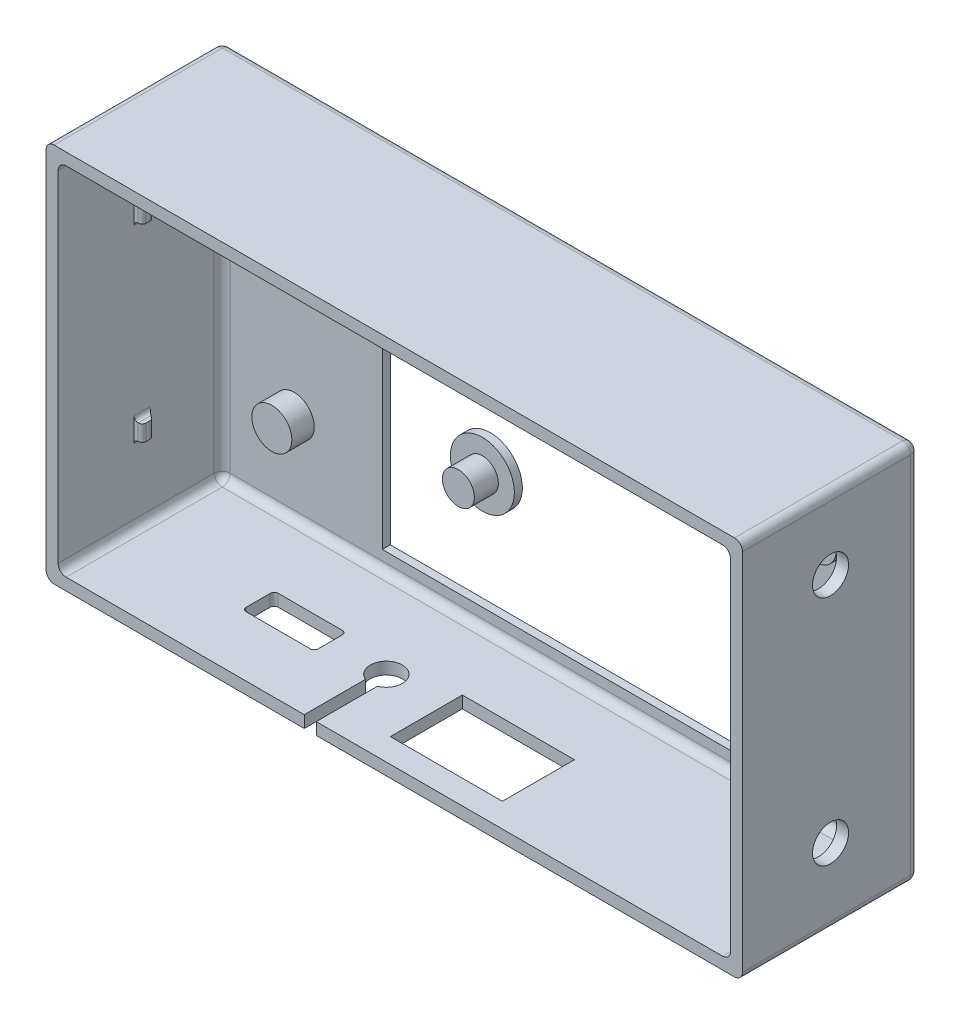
ISO-10303-21;
HEADER;
FILE_DESCRIPTION(('STEP AP214'),'2;1');
FILE_NAME('part.step','',(''),(''),'','','');
FILE_SCHEMA(('AUTOMOTIVE_DESIGN { 1 0 10303 214 1 1 1 1 }'));
ENDSEC;
DATA;
#1=APPLICATION_CONTEXT('core data for automotive mechanical design processes');
#2=APPLICATION_PROTOCOL_DEFINITION('international standard','automotive_design',2000,#1);
#3=PRODUCT_CONTEXT('',#1,'mechanical');
#4=PRODUCT('Part','Part','',(#3));
#5=PRODUCT_RELATED_PRODUCT_CATEGORY('part','',(#4));
#6=PRODUCT_DEFINITION_FORMATION('','',#4);
#7=PRODUCT_DEFINITION_CONTEXT('part definition',#1,'design');
#8=PRODUCT_DEFINITION('design','',#6,#7);
#9=PRODUCT_DEFINITION_SHAPE('','',#8);
#10=(LENGTH_UNIT() NAMED_UNIT(*) SI_UNIT(.MILLI.,.METRE.));
#11=(NAMED_UNIT(*) PLANE_ANGLE_UNIT() SI_UNIT($,.RADIAN.));
#12=(NAMED_UNIT(*) SI_UNIT($,.STERADIAN.) SOLID_ANGLE_UNIT());
#13=UNCERTAINTY_MEASURE_WITH_UNIT(LENGTH_MEASURE(1.E-05),#10,'distance_accuracy_value','');
#14=(GEOMETRIC_REPRESENTATION_CONTEXT(3) GLOBAL_UNCERTAINTY_ASSIGNED_CONTEXT((#13)) GLOBAL_UNIT_ASSIGNED_CONTEXT((#10,
#11,#12)) REPRESENTATION_CONTEXT('',''));
#15=CARTESIAN_POINT('',(0.,0.,0.));
#16=DIRECTION('',(0.,0.,1.));
#17=DIRECTION('',(1.,0.,0.));
#18=AXIS2_PLACEMENT_3D('',#15,#16,#17);
#19=CARTESIAN_POINT('',(-10.,-6.10862880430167,4.));
#20=DIRECTION('',(0.,0.,-1.));
#21=DIRECTION('',(-1.,0.,0.));
#22=AXIS2_PLACEMENT_3D('',#19,#20,#21);
#23=CYLINDRICAL_SURFACE('',#22,2.);
#24=CARTESIAN_POINT('',(-10.,-6.10862880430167,4.));
#25=DIRECTION('',(0.,0.,1.));
#26=DIRECTION('',(1.,0.,0.));
#27=AXIS2_PLACEMENT_3D('',#24,#25,#26);
#28=CIRCLE('',#27,2.);
#29=CARTESIAN_POINT('',(-8.,-6.10862880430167,4.));
#30=VERTEX_POINT('',#29);
#31=EDGE_CURVE('E56',#30,#30,#28,.T.);
#32=ORIENTED_EDGE('',*,*,#31,.F.);
#33=EDGE_LOOP('',(#32));
#34=FACE_BOUND('',#33,.T.);
#35=CARTESIAN_POINT('',(-10.,-6.10862880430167,1.));
#36=DIRECTION('',(0.,0.,1.));
#37=DIRECTION('',(1.,0.,0.));
#38=AXIS2_PLACEMENT_3D('',#35,#36,#37);
#39=CIRCLE('',#38,2.);
#40=CARTESIAN_POINT('',(-8.,-6.10862880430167,1.));
#41=VERTEX_POINT('',#40);
#42=EDGE_CURVE('E12',#41,#41,#39,.T.);
#43=ORIENTED_EDGE('',*,*,#42,.T.);
#44=EDGE_LOOP('',(#43));
#45=FACE_BOUND('',#44,.T.);
#46=ADVANCED_FACE('F52',(#34,#45),#23,.T.);
#47=CARTESIAN_POINT('',(-10.,-6.10862880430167,4.));
#48=DIRECTION('',(0.,0.,1.));
#49=DIRECTION('',(1.,0.,0.));
#50=AXIS2_PLACEMENT_3D('',#47,#48,#49);
#51=PLANE('',#50);
#52=ORIENTED_EDGE('',*,*,#31,.T.);
#53=EDGE_LOOP('',(#52));
#54=FACE_BOUND('',#53,.T.);
#55=ADVANCED_FACE('F54',(#54),#51,.T.);
#56=CARTESIAN_POINT('',(-10.,-6.10862880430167,1.));
#57=DIRECTION('',(0.,0.,1.));
#58=DIRECTION('',(1.,0.,0.));
#59=AXIS2_PLACEMENT_3D('',#56,#57,#58);
#60=PLANE('',#59);
#61=ORIENTED_EDGE('',*,*,#42,.F.);
#62=EDGE_LOOP('',(#61));
#63=FACE_BOUND('',#62,.T.);
#64=ADVANCED_FACE('F71',(#63),#60,.F.);
#65=CLOSED_SHELL('',(#46,#55,#64));
#66=MANIFOLD_SOLID_BREP('B2',#65);
#67=CARTESIAN_POINT('',(-10.,-6.10862880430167,1.));
#68=DIRECTION('',(0.,0.,-1.));
#69=DIRECTION('',(-1.,0.,0.));
#70=AXIS2_PLACEMENT_3D('',#67,#68,#69);
#71=CYLINDRICAL_SURFACE('',#70,4.);
#72=CARTESIAN_POINT('',(-10.,-6.10862880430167,1.));
#73=DIRECTION('',(0.,0.,1.));
#74=DIRECTION('',(1.,0.,0.));
#75=AXIS2_PLACEMENT_3D('',#72,#73,#74);
#76=CIRCLE('',#75,4.);
#77=CARTESIAN_POINT('',(-6.,-6.10862880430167,1.));
#78=VERTEX_POINT('',#77);
#79=EDGE_CURVE('E105',#78,#78,#76,.T.);
#80=ORIENTED_EDGE('',*,*,#79,.F.);
#81=EDGE_LOOP('',(#80));
#82=FACE_BOUND('',#81,.T.);
#83=CARTESIAN_POINT('',(-10.,-6.10862880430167,0.));
#84=DIRECTION('',(0.,0.,1.));
#85=DIRECTION('',(1.,0.,0.));
#86=AXIS2_PLACEMENT_3D('',#83,#84,#85);
#87=CIRCLE('',#86,4.);
#88=CARTESIAN_POINT('',(-6.,-6.10862880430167,0.));
#89=VERTEX_POINT('',#88);
#90=EDGE_CURVE('E51',#89,#89,#87,.T.);
#91=ORIENTED_EDGE('',*,*,#90,.T.);
#92=EDGE_LOOP('',(#91));
#93=FACE_BOUND('',#92,.T.);
#94=ADVANCED_FACE('F101',(#82,#93),#71,.T.);
#95=CARTESIAN_POINT('',(-10.,-6.10862880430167,1.));
#96=DIRECTION('',(0.,0.,1.));
#97=DIRECTION('',(1.,0.,0.));
#98=AXIS2_PLACEMENT_3D('',#95,#96,#97);
#99=PLANE('',#98);
#100=ORIENTED_EDGE('',*,*,#79,.T.);
#101=EDGE_LOOP('',(#100));
#102=FACE_BOUND('',#101,.T.);
#103=ADVANCED_FACE('F103',(#102),#99,.T.);
#104=CARTESIAN_POINT('',(-10.,-6.10862880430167,0.));
#105=DIRECTION('',(0.,0.,1.));
#106=DIRECTION('',(1.,0.,0.));
#107=AXIS2_PLACEMENT_3D('',#104,#105,#106);
#108=PLANE('',#107);
#109=ORIENTED_EDGE('',*,*,#90,.F.);
#110=EDGE_LOOP('',(#109));
#111=FACE_BOUND('',#110,.T.);
#112=ADVANCED_FACE('F120',(#111),#108,.F.);
#113=CLOSED_SHELL('',(#94,#103,#112));
#114=MANIFOLD_SOLID_BREP('B7',#113);
#115=CARTESIAN_POINT('',(0.,7.24511788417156,1.));
#116=DIRECTION('',(0.,0.,-1.));
#117=DIRECTION('',(-1.,0.,0.));
#118=AXIS2_PLACEMENT_3D('',#115,#116,#117);
#119=CYLINDRICAL_SURFACE('',#118,4.);
#120=CARTESIAN_POINT('',(0.,7.24511788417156,1.));
#121=DIRECTION('',(0.,0.,1.));
#122=DIRECTION('',(1.,0.,0.));
#123=AXIS2_PLACEMENT_3D('',#120,#121,#122);
#124=CIRCLE('',#123,4.);
#125=CARTESIAN_POINT('',(4.,7.24511788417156,1.));
#126=VERTEX_POINT('',#125);
#127=EDGE_CURVE('E154',#126,#126,#124,.T.);
#128=ORIENTED_EDGE('',*,*,#127,.F.);
#129=EDGE_LOOP('',(#128));
#130=FACE_BOUND('',#129,.T.);
#131=CARTESIAN_POINT('',(0.,7.24511788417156,0.));
#132=DIRECTION('',(0.,0.,1.));
#133=DIRECTION('',(1.,0.,0.));
#134=AXIS2_PLACEMENT_3D('',#131,#132,#133);
#135=CIRCLE('',#134,4.);
#136=CARTESIAN_POINT('',(4.,7.24511788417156,0.));
#137=VERTEX_POINT('',#136);
#138=EDGE_CURVE('E158',#137,#137,#135,.T.);
#139=ORIENTED_EDGE('',*,*,#138,.T.);
#140=EDGE_LOOP('',(#139));
#141=FACE_BOUND('',#140,.T.);
#142=ADVANCED_FACE('F150',(#130,#141),#119,.T.);
#143=CARTESIAN_POINT('',(0.,7.24511788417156,1.));
#144=DIRECTION('',(0.,0.,1.));
#145=DIRECTION('',(1.,0.,0.));
#146=AXIS2_PLACEMENT_3D('',#143,#144,#145);
#147=PLANE('',#146);
#148=CARTESIAN_POINT('',(0.,7.24511788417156,1.));
#149=DIRECTION('',(0.,0.,1.));
#150=DIRECTION('',(1.,0.,0.));
#151=AXIS2_PLACEMENT_3D('',#148,#149,#150);
#152=CIRCLE('',#151,2.);
#153=CARTESIAN_POINT('',(2.,7.24511788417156,1.));
#154=VERTEX_POINT('',#153);
#155=EDGE_CURVE('E100',#154,#154,#152,.T.);
#156=ORIENTED_EDGE('',*,*,#155,.F.);
#157=EDGE_LOOP('',(#156));
#158=FACE_BOUND('',#157,.T.);
#159=ORIENTED_EDGE('',*,*,#127,.T.);
#160=EDGE_LOOP('',(#159));
#161=FACE_BOUND('',#160,.T.);
#162=ADVANCED_FACE('F152',(#158,#161),#147,.T.);
#163=CARTESIAN_POINT('',(0.,7.24511788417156,0.));
#164=DIRECTION('',(0.,0.,1.));
#165=DIRECTION('',(1.,0.,0.));
#166=AXIS2_PLACEMENT_3D('',#163,#164,#165);
#167=PLANE('',#166);
#168=ORIENTED_EDGE('',*,*,#138,.F.);
#169=EDGE_LOOP('',(#168));
#170=FACE_BOUND('',#169,.T.);
#171=ADVANCED_FACE('F177',(#170),#167,.F.);
#172=CARTESIAN_POINT('',(0.,7.24511788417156,4.));
#173=DIRECTION('',(0.,0.,-1.));
#174=DIRECTION('',(-1.,0.,0.));
#175=AXIS2_PLACEMENT_3D('',#172,#173,#174);
#176=CYLINDRICAL_SURFACE('',#175,2.);
#177=CARTESIAN_POINT('',(0.,7.24511788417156,4.));
#178=DIRECTION('',(0.,0.,1.));
#179=DIRECTION('',(1.,0.,0.));
#180=AXIS2_PLACEMENT_3D('',#177,#178,#179);
#181=CIRCLE('',#180,2.);
#182=CARTESIAN_POINT('',(2.,7.24511788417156,4.));
#183=VERTEX_POINT('',#182);
#184=EDGE_CURVE('E164',#183,#183,#181,.T.);
#185=ORIENTED_EDGE('',*,*,#184,.F.);
#186=EDGE_LOOP('',(#185));
#187=FACE_BOUND('',#186,.T.);
#188=ORIENTED_EDGE('',*,*,#155,.T.);
#189=EDGE_LOOP('',(#188));
#190=FACE_BOUND('',#189,.T.);
#191=ADVANCED_FACE('F179',(#187,#190),#176,.T.);
#192=CARTESIAN_POINT('',(0.,7.24511788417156,4.));
#193=DIRECTION('',(0.,0.,1.));
#194=DIRECTION('',(1.,0.,0.));
#195=AXIS2_PLACEMENT_3D('',#192,#193,#194);
#196=PLANE('',#195);
#197=ORIENTED_EDGE('',*,*,#184,.T.);
#198=EDGE_LOOP('',(#197));
#199=FACE_BOUND('',#198,.T.);
#200=ADVANCED_FACE('F184',(#199),#196,.T.);
#201=CLOSED_SHELL('',(#142,#162,#171,#191,#200));
#202=MANIFOLD_SOLID_BREP('B46',#201);
#203=CARTESIAN_POINT('',(-10.,7.24511788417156,1.));
#204=DIRECTION('',(0.,0.,-1.));
#205=DIRECTION('',(-1.,0.,0.));
#206=AXIS2_PLACEMENT_3D('',#203,#204,#205);
#207=CYLINDRICAL_SURFACE('',#206,4.);
#208=CARTESIAN_POINT('',(-10.,7.24511788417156,1.));
#209=DIRECTION('',(0.,0.,1.));
#210=DIRECTION('',(1.,0.,0.));
#211=AXIS2_PLACEMENT_3D('',#208,#209,#210);
#212=CIRCLE('',#211,4.);
#213=CARTESIAN_POINT('',(-6.,7.24511788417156,1.));
#214=VERTEX_POINT('',#213);
#215=EDGE_CURVE('E237',#214,#214,#212,.T.);
#216=ORIENTED_EDGE('',*,*,#215,.F.);
#217=EDGE_LOOP('',(#216));
#218=FACE_BOUND('',#217,.T.);
#219=CARTESIAN_POINT('',(-10.,7.24511788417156,0.));
#220=DIRECTION('',(0.,0.,1.));
#221=DIRECTION('',(1.,0.,0.));
#222=AXIS2_PLACEMENT_3D('',#219,#220,#221);
#223=CIRCLE('',#222,4.);
#224=CARTESIAN_POINT('',(-6.,7.24511788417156,0.));
#225=VERTEX_POINT('',#224);
#226=EDGE_CURVE('E233',#225,#225,#223,.T.);
#227=ORIENTED_EDGE('',*,*,#226,.T.);
#228=EDGE_LOOP('',(#227));
#229=FACE_BOUND('',#228,.T.);
#230=ADVANCED_FACE('F230',(#218,#229),#207,.T.);
#231=CARTESIAN_POINT('',(-10.,7.24511788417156,1.));
#232=DIRECTION('',(0.,0.,1.));
#233=DIRECTION('',(1.,0.,0.));
#234=AXIS2_PLACEMENT_3D('',#231,#232,#233);
#235=PLANE('',#234);
#236=CARTESIAN_POINT('',(-10.,7.24511788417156,1.));
#237=DIRECTION('',(0.,0.,1.));
#238=DIRECTION('',(1.,0.,0.));
#239=AXIS2_PLACEMENT_3D('',#236,#237,#238);
#240=CIRCLE('',#239,2.);
#241=CARTESIAN_POINT('',(-8.,7.24511788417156,1.));
#242=VERTEX_POINT('',#241);
#243=EDGE_CURVE('E149',#242,#242,#240,.T.);
#244=ORIENTED_EDGE('',*,*,#243,.F.);
#245=EDGE_LOOP('',(#244));
#246=FACE_BOUND('',#245,.T.);
#247=ORIENTED_EDGE('',*,*,#215,.T.);
#248=EDGE_LOOP('',(#247));
#249=FACE_BOUND('',#248,.T.);
#250=ADVANCED_FACE('F254',(#246,#249),#235,.T.);
#251=CARTESIAN_POINT('',(-10.,7.24511788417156,0.));
#252=DIRECTION('',(0.,0.,1.));
#253=DIRECTION('',(1.,0.,0.));
#254=AXIS2_PLACEMENT_3D('',#251,#252,#253);
#255=PLANE('',#254);
#256=ORIENTED_EDGE('',*,*,#226,.F.);
#257=EDGE_LOOP('',(#256));
#258=FACE_BOUND('',#257,.T.);
#259=ADVANCED_FACE('F251',(#258),#255,.F.);
#260=CARTESIAN_POINT('',(-10.,7.24511788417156,4.));
#261=DIRECTION('',(0.,0.,-1.));
#262=DIRECTION('',(-1.,0.,0.));
#263=AXIS2_PLACEMENT_3D('',#260,#261,#262);
#264=CYLINDRICAL_SURFACE('',#263,2.);
#265=CARTESIAN_POINT('',(-10.,7.24511788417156,4.));
#266=DIRECTION('',(0.,0.,1.));
#267=DIRECTION('',(1.,0.,0.));
#268=AXIS2_PLACEMENT_3D('',#265,#266,#267);
#269=CIRCLE('',#268,2.);
#270=CARTESIAN_POINT('',(-8.,7.24511788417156,4.));
#271=VERTEX_POINT('',#270);
#272=EDGE_CURVE('E243',#271,#271,#269,.T.);
#273=ORIENTED_EDGE('',*,*,#272,.F.);
#274=EDGE_LOOP('',(#273));
#275=FACE_BOUND('',#274,.T.);
#276=ORIENTED_EDGE('',*,*,#243,.T.);
#277=EDGE_LOOP('',(#276));
#278=FACE_BOUND('',#277,.T.);
#279=ADVANCED_FACE('F253',(#275,#278),#264,.T.);
#280=CARTESIAN_POINT('',(-10.,7.24511788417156,4.));
#281=DIRECTION('',(0.,0.,1.));
#282=DIRECTION('',(1.,0.,0.));
#283=AXIS2_PLACEMENT_3D('',#280,#281,#282);
#284=PLANE('',#283);
#285=ORIENTED_EDGE('',*,*,#272,.T.);
#286=EDGE_LOOP('',(#285));
#287=FACE_BOUND('',#286,.T.);
#288=ADVANCED_FACE('F260',(#287),#284,.T.);
#289=CLOSED_SHELL('',(#230,#250,#259,#279,#288));
#290=MANIFOLD_SOLID_BREP('B95',#289);
#291=CARTESIAN_POINT('',(-42.,-22.25,1.5));
#292=DIRECTION('',(-1.,0.,0.));
#293=DIRECTION('',(0.,0.,1.));
#294=AXIS2_PLACEMENT_3D('',#291,#292,#293);
#295=PLANE('',#294);
#296=DIRECTION('',(0.,-1.,0.));
#297=VECTOR('',#296,1.);
#298=CARTESIAN_POINT('',(-42.,13.0507550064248,12.5));
#299=LINE('',#298,#297);
#300=CARTESIAN_POINT('',(-42.,13.5507550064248,12.5));
#301=VERTEX_POINT('',#300);
#302=CARTESIAN_POINT('',(-42.,10.5507550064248,12.5));
#303=VERTEX_POINT('',#302);
#304=EDGE_CURVE('E1132',#301,#303,#299,.T.);
#305=ORIENTED_EDGE('',*,*,#304,.F.);
#306=DIRECTION('',(0.,0.,1.));
#307=VECTOR('',#306,1.);
#308=CARTESIAN_POINT('',(-42.,13.5507550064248,10.5));
#309=LINE('',#308,#307);
#310=CARTESIAN_POINT('',(-42.,13.5507550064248,10.5));
#311=VERTEX_POINT('',#310);
#312=EDGE_CURVE('E1054',#301,#311,#309,.F.);
#313=ORIENTED_EDGE('',*,*,#312,.T.);
#314=DIRECTION('',(0.,1.,0.));
#315=VECTOR('',#314,1.);
#316=CARTESIAN_POINT('',(-42.,13.0507550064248,10.5));
#317=LINE('',#316,#315);
#318=CARTESIAN_POINT('',(-42.,10.5507550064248,10.5));
#319=VERTEX_POINT('',#318);
#320=EDGE_CURVE('E1125',#319,#311,#317,.T.);
#321=ORIENTED_EDGE('',*,*,#320,.F.);
#322=DIRECTION('',(0.,0.,-1.));
#323=VECTOR('',#322,1.);
#324=CARTESIAN_POINT('',(-42.,10.5507550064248,12.5));
#325=LINE('',#324,#323);
#326=EDGE_CURVE('E1051',#319,#303,#325,.F.);
#327=ORIENTED_EDGE('',*,*,#326,.T.);
#328=EDGE_LOOP('',(#305,#313,#321,#327));
#329=FACE_BOUND('',#328,.T.);
#330=DIRECTION('',(0.,-1.,0.));
#331=VECTOR('',#330,1.);
#332=CARTESIAN_POINT('',(-42.,-22.25,2.5));
#333=LINE('',#332,#331);
#334=CARTESIAN_POINT('',(-42.,-21.25,2.5));
#335=VERTEX_POINT('',#334);
#336=CARTESIAN_POINT('',(-42.,21.25,2.5));
#337=VERTEX_POINT('',#336);
#338=EDGE_CURVE('E849',#335,#337,#333,.F.);
#339=ORIENTED_EDGE('',*,*,#338,.T.);
#340=DIRECTION('',(0.,0.,1.));
#341=VECTOR('',#340,1.);
#342=CARTESIAN_POINT('',(-42.,21.25,22.));
#343=LINE('',#342,#341);
#344=CARTESIAN_POINT('',(-42.,21.25,22.));
#345=VERTEX_POINT('',#344);
#346=EDGE_CURVE('E851',#337,#345,#343,.T.);
#347=ORIENTED_EDGE('',*,*,#346,.T.);
#348=DIRECTION('',(0.,-1.,0.));
#349=VECTOR('',#348,1.);
#350=CARTESIAN_POINT('',(-42.,-22.25,22.));
#351=LINE('',#350,#349);
#352=CARTESIAN_POINT('',(-42.,-21.25,22.));
#353=VERTEX_POINT('',#352);
#354=EDGE_CURVE('E742',#345,#353,#351,.T.);
#355=ORIENTED_EDGE('',*,*,#354,.T.);
#356=DIRECTION('',(0.,0.,1.));
#357=VECTOR('',#356,1.);
#358=CARTESIAN_POINT('',(-42.,-21.25,1.5));
#359=LINE('',#358,#357);
#360=EDGE_CURVE('E847',#353,#335,#359,.F.);
#361=ORIENTED_EDGE('',*,*,#360,.T.);
#362=EDGE_LOOP('',(#339,#347,#355,#361));
#363=FACE_BOUND('',#362,.T.);
#364=DIRECTION('',(0.,-1.,0.));
#365=VECTOR('',#364,1.);
#366=CARTESIAN_POINT('',(-42.,-10.5596613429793,12.5));
#367=LINE('',#366,#365);
#368=CARTESIAN_POINT('',(-42.,-10.0596613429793,12.5));
#369=VERTEX_POINT('',#368);
#370=CARTESIAN_POINT('',(-42.,-13.0596613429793,12.5));
#371=VERTEX_POINT('',#370);
#372=EDGE_CURVE('E1139',#369,#371,#367,.T.);
#373=ORIENTED_EDGE('',*,*,#372,.F.);
#374=DIRECTION('',(0.,0.,1.));
#375=VECTOR('',#374,1.);
#376=CARTESIAN_POINT('',(-42.,-10.0596613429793,10.5));
#377=LINE('',#376,#375);
#378=CARTESIAN_POINT('',(-42.,-10.0596613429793,10.5));
#379=VERTEX_POINT('',#378);
#380=EDGE_CURVE('E1060',#369,#379,#377,.F.);
#381=ORIENTED_EDGE('',*,*,#380,.T.);
#382=DIRECTION('',(0.,1.,0.));
#383=VECTOR('',#382,1.);
#384=CARTESIAN_POINT('',(-42.,-10.5596613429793,10.5));
#385=LINE('',#384,#383);
#386=CARTESIAN_POINT('',(-42.,-13.0596613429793,10.5));
#387=VERTEX_POINT('',#386);
#388=EDGE_CURVE('E1135',#387,#379,#385,.T.);
#389=ORIENTED_EDGE('',*,*,#388,.F.);
#390=DIRECTION('',(0.,0.,-1.));
#391=VECTOR('',#390,1.);
#392=CARTESIAN_POINT('',(-42.,-13.0596613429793,12.5));
#393=LINE('',#392,#391);
#394=EDGE_CURVE('E1057',#387,#371,#393,.F.);
#395=ORIENTED_EDGE('',*,*,#394,.T.);
#396=EDGE_LOOP('',(#373,#381,#389,#395));
#397=FACE_BOUND('',#396,.T.);
#398=ADVANCED_FACE('F301',(#329,#363,#397),#295,.F.);
#399=CARTESIAN_POINT('',(-22.,20.,22.));
#400=DIRECTION('',(1.,0.,0.));
#401=DIRECTION('',(0.,1.,0.));
#402=AXIS2_PLACEMENT_3D('',#399,#400,#401);
#403=PLANE('',#402);
#404=DIRECTION('',(0.,0.,-1.));
#405=VECTOR('',#404,1.);
#406=CARTESIAN_POINT('',(-22.,-20.,22.));
#407=LINE('',#406,#405);
#408=CARTESIAN_POINT('',(-22.,-20.,1.5));
#409=VERTEX_POINT('',#408);
#410=CARTESIAN_POINT('',(-22.,-20.,0.5));
#411=VERTEX_POINT('',#410);
#412=EDGE_CURVE('E774',#409,#411,#407,.T.);
#413=ORIENTED_EDGE('',*,*,#412,.T.);
#414=DIRECTION('',(0.,1.,0.));
#415=VECTOR('',#414,1.);
#416=CARTESIAN_POINT('',(-22.,20.,0.5));
#417=LINE('',#416,#415);
#418=CARTESIAN_POINT('',(-22.,20.,0.5));
#419=VERTEX_POINT('',#418);
#420=EDGE_CURVE('E966',#411,#419,#417,.T.);
#421=ORIENTED_EDGE('',*,*,#420,.T.);
#422=DIRECTION('',(0.,0.,-1.));
#423=VECTOR('',#422,1.);
#424=CARTESIAN_POINT('',(-22.,20.,22.));
#425=LINE('',#424,#423);
#426=CARTESIAN_POINT('',(-22.,20.,1.5));
#427=VERTEX_POINT('',#426);
#428=EDGE_CURVE('E765',#427,#419,#425,.T.);
#429=ORIENTED_EDGE('',*,*,#428,.F.);
#430=DIRECTION('',(0.,-1.,0.));
#431=VECTOR('',#430,1.);
#432=CARTESIAN_POINT('',(-22.,20.,1.5));
#433=LINE('',#432,#431);
#434=EDGE_CURVE('E762',#427,#409,#433,.T.);
#435=ORIENTED_EDGE('',*,*,#434,.T.);
#436=EDGE_LOOP('',(#413,#421,#429,#435));
#437=FACE_BOUND('',#436,.T.);
#438=ADVANCED_FACE('F1300',(#437),#403,.T.);
#439=CARTESIAN_POINT('',(-22.,-20.,22.));
#440=DIRECTION('',(0.,1.,0.));
#441=DIRECTION('',(0.,0.,1.));
#442=AXIS2_PLACEMENT_3D('',#439,#440,#441);
#443=PLANE('',#442);
#444=DIRECTION('',(0.,0.,-1.));
#445=VECTOR('',#444,1.);
#446=CARTESIAN_POINT('',(30.,-20.,22.));
#447=LINE('',#446,#445);
#448=CARTESIAN_POINT('',(30.,-20.,1.5));
#449=VERTEX_POINT('',#448);
#450=CARTESIAN_POINT('',(30.,-20.,0.5));
#451=VERTEX_POINT('',#450);
#452=EDGE_CURVE('E771',#449,#451,#447,.T.);
#453=ORIENTED_EDGE('',*,*,#452,.T.);
#454=DIRECTION('',(-1.,0.,0.));
#455=VECTOR('',#454,1.);
#456=CARTESIAN_POINT('',(-22.,-20.,0.5));
#457=LINE('',#456,#455);
#458=EDGE_CURVE('E968',#451,#411,#457,.T.);
#459=ORIENTED_EDGE('',*,*,#458,.T.);
#460=ORIENTED_EDGE('',*,*,#412,.F.);
#461=DIRECTION('',(1.,0.,0.));
#462=VECTOR('',#461,1.);
#463=CARTESIAN_POINT('',(-22.,-20.,1.5));
#464=LINE('',#463,#462);
#465=EDGE_CURVE('E759',#409,#449,#464,.T.);
#466=ORIENTED_EDGE('',*,*,#465,.T.);
#467=EDGE_LOOP('',(#453,#459,#460,#466));
#468=FACE_BOUND('',#467,.T.);
#469=ADVANCED_FACE('F1307',(#468),#443,.T.);
#470=CARTESIAN_POINT('',(30.,20.,22.));
#471=DIRECTION('',(-1.,0.,0.));
#472=DIRECTION('',(0.,0.,1.));
#473=AXIS2_PLACEMENT_3D('',#470,#471,#472);
#474=PLANE('',#473);
#475=DIRECTION('',(0.,0.,-1.));
#476=VECTOR('',#475,1.);
#477=CARTESIAN_POINT('',(30.,20.,22.));
#478=LINE('',#477,#476);
#479=CARTESIAN_POINT('',(30.,20.,1.5));
#480=VERTEX_POINT('',#479);
#481=CARTESIAN_POINT('',(30.,20.,0.5));
#482=VERTEX_POINT('',#481);
#483=EDGE_CURVE('E768',#480,#482,#478,.T.);
#484=ORIENTED_EDGE('',*,*,#483,.T.);
#485=DIRECTION('',(0.,-1.,0.));
#486=VECTOR('',#485,1.);
#487=CARTESIAN_POINT('',(30.,20.,0.5));
#488=LINE('',#487,#486);
#489=EDGE_CURVE('E961',#482,#451,#488,.T.);
#490=ORIENTED_EDGE('',*,*,#489,.T.);
#491=ORIENTED_EDGE('',*,*,#452,.F.);
#492=DIRECTION('',(0.,1.,0.));
#493=VECTOR('',#492,1.);
#494=CARTESIAN_POINT('',(30.,20.,1.5));
#495=LINE('',#494,#493);
#496=EDGE_CURVE('E756',#449,#480,#495,.T.);
#497=ORIENTED_EDGE('',*,*,#496,.T.);
#498=EDGE_LOOP('',(#484,#490,#491,#497));
#499=FACE_BOUND('',#498,.T.);
#500=ADVANCED_FACE('F1315',(#499),#474,.T.);
#501=CARTESIAN_POINT('',(-22.,20.,22.));
#502=DIRECTION('',(0.,-1.,0.));
#503=DIRECTION('',(0.,0.,-1.));
#504=AXIS2_PLACEMENT_3D('',#501,#502,#503);
#505=PLANE('',#504);
#506=ORIENTED_EDGE('',*,*,#428,.T.);
#507=DIRECTION('',(1.,0.,0.));
#508=VECTOR('',#507,1.);
#509=CARTESIAN_POINT('',(-22.,20.,0.5));
#510=LINE('',#509,#508);
#511=EDGE_CURVE('E964',#419,#482,#510,.T.);
#512=ORIENTED_EDGE('',*,*,#511,.T.);
#513=ORIENTED_EDGE('',*,*,#483,.F.);
#514=DIRECTION('',(-1.,0.,0.));
#515=VECTOR('',#514,1.);
#516=CARTESIAN_POINT('',(-22.,20.,1.5));
#517=LINE('',#516,#515);
#518=EDGE_CURVE('E790',#480,#427,#517,.T.);
#519=ORIENTED_EDGE('',*,*,#518,.T.);
#520=EDGE_LOOP('',(#506,#512,#513,#519));
#521=FACE_BOUND('',#520,.T.);
#522=ADVANCED_FACE('F1312',(#521),#505,.T.);
#523=CARTESIAN_POINT('',(0.,0.,22.));
#524=DIRECTION('',(0.,0.,-1.));
#525=DIRECTION('',(-1.,0.,0.));
#526=AXIS2_PLACEMENT_3D('',#523,#524,#525);
#527=PLANE('',#526);
#528=DIRECTION('',(1.,0.,0.));
#529=VECTOR('',#528,1.);
#530=CARTESIAN_POINT('',(43.5,-23.75,22.));
#531=LINE('',#530,#529);
#532=CARTESIAN_POINT('',(-42.5,-23.75,22.));
#533=VERTEX_POINT('',#532);
#534=CARTESIAN_POINT('',(-11.25,-23.75,22.));
#535=VERTEX_POINT('',#534);
#536=EDGE_CURVE('E781',#533,#535,#531,.T.);
#537=ORIENTED_EDGE('',*,*,#536,.T.);
#538=DIRECTION('',(0.,1.,0.));
#539=VECTOR('',#538,1.);
#540=CARTESIAN_POINT('',(-11.25,0.,22.));
#541=LINE('',#540,#539);
#542=CARTESIAN_POINT('',(-11.25,-22.25,22.));
#543=VERTEX_POINT('',#542);
#544=EDGE_CURVE('E705',#535,#543,#541,.T.);
#545=ORIENTED_EDGE('',*,*,#544,.T.);
#546=DIRECTION('',(1.,0.,0.));
#547=VECTOR('',#546,1.);
#548=CARTESIAN_POINT('',(42.,-22.25,22.));
#549=LINE('',#548,#547);
#550=CARTESIAN_POINT('',(-41.,-22.25,22.));
#551=VERTEX_POINT('',#550);
#552=EDGE_CURVE('E747',#551,#543,#549,.T.);
#553=ORIENTED_EDGE('',*,*,#552,.F.);
#554=CARTESIAN_POINT('',(-41.,-21.25,22.));
#555=DIRECTION('',(0.,0.,-1.));
#556=DIRECTION('',(-1.,0.,0.));
#557=AXIS2_PLACEMENT_3D('',#554,#555,#556);
#558=CIRCLE('',#557,1.);
#559=EDGE_CURVE('E876',#551,#353,#558,.T.);
#560=ORIENTED_EDGE('',*,*,#559,.T.);
#561=ORIENTED_EDGE('',*,*,#354,.F.);
#562=CARTESIAN_POINT('',(-41.,21.25,22.));
#563=DIRECTION('',(0.,0.,-1.));
#564=DIRECTION('',(-1.,0.,0.));
#565=AXIS2_PLACEMENT_3D('',#562,#563,#564);
#566=CIRCLE('',#565,1.);
#567=CARTESIAN_POINT('',(-41.,22.25,22.));
#568=VERTEX_POINT('',#567);
#569=EDGE_CURVE('E874',#345,#568,#566,.T.);
#570=ORIENTED_EDGE('',*,*,#569,.T.);
#571=DIRECTION('',(-1.,0.,0.));
#572=VECTOR('',#571,1.);
#573=CARTESIAN_POINT('',(42.,22.25,22.));
#574=LINE('',#573,#572);
#575=CARTESIAN_POINT('',(41.,22.25,22.));
#576=VERTEX_POINT('',#575);
#577=EDGE_CURVE('E753',#576,#568,#574,.T.);
#578=ORIENTED_EDGE('',*,*,#577,.F.);
#579=CARTESIAN_POINT('',(41.,21.25,22.));
#580=DIRECTION('',(0.,0.,-1.));
#581=DIRECTION('',(-1.,0.,0.));
#582=AXIS2_PLACEMENT_3D('',#579,#580,#581);
#583=CIRCLE('',#582,1.);
#584=CARTESIAN_POINT('',(42.,21.25,22.));
#585=VERTEX_POINT('',#584);
#586=EDGE_CURVE('E881',#576,#585,#583,.T.);
#587=ORIENTED_EDGE('',*,*,#586,.T.);
#588=DIRECTION('',(0.,1.,0.));
#589=VECTOR('',#588,1.);
#590=CARTESIAN_POINT('',(42.,-22.25,22.));
#591=LINE('',#590,#589);
#592=CARTESIAN_POINT('',(42.,-21.25,22.));
#593=VERTEX_POINT('',#592);
#594=EDGE_CURVE('E750',#593,#585,#591,.T.);
#595=ORIENTED_EDGE('',*,*,#594,.F.);
#596=CARTESIAN_POINT('',(41.,-21.25,22.));
#597=DIRECTION('',(0.,0.,-1.));
#598=DIRECTION('',(-1.,0.,0.));
#599=AXIS2_PLACEMENT_3D('',#596,#597,#598);
#600=CIRCLE('',#599,1.);
#601=CARTESIAN_POINT('',(41.,-22.25,22.));
#602=VERTEX_POINT('',#601);
#603=EDGE_CURVE('E878',#593,#602,#600,.T.);
#604=ORIENTED_EDGE('',*,*,#603,.T.);
#605=CARTESIAN_POINT('',(-9.74999999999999,-22.25,22.));
#606=VERTEX_POINT('',#605);
#607=EDGE_CURVE('E745',#606,#602,#549,.T.);
#608=ORIENTED_EDGE('',*,*,#607,.F.);
#609=DIRECTION('',(0.,-1.,0.));
#610=VECTOR('',#609,1.);
#611=CARTESIAN_POINT('',(-9.74999999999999,0.,22.));
#612=LINE('',#611,#610);
#613=CARTESIAN_POINT('',(-9.74999999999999,-23.75,22.));
#614=VERTEX_POINT('',#613);
#615=EDGE_CURVE('E702',#606,#614,#612,.T.);
#616=ORIENTED_EDGE('',*,*,#615,.T.);
#617=CARTESIAN_POINT('',(42.5,-23.75,22.));
#618=VERTEX_POINT('',#617);
#619=EDGE_CURVE('E780',#614,#618,#531,.T.);
#620=ORIENTED_EDGE('',*,*,#619,.T.);
#621=CARTESIAN_POINT('',(42.5,-22.75,22.));
#622=DIRECTION('',(0.,0.,-1.));
#623=DIRECTION('',(-1.,0.,0.));
#624=AXIS2_PLACEMENT_3D('',#621,#622,#623);
#625=CIRCLE('',#624,1.);
#626=CARTESIAN_POINT('',(43.5,-22.75,22.));
#627=VERTEX_POINT('',#626);
#628=EDGE_CURVE('E817',#618,#627,#625,.F.);
#629=ORIENTED_EDGE('',*,*,#628,.T.);
#630=DIRECTION('',(0.,1.,0.));
#631=VECTOR('',#630,1.);
#632=CARTESIAN_POINT('',(43.5,23.75,22.));
#633=LINE('',#632,#631);
#634=CARTESIAN_POINT('',(43.5,22.75,22.));
#635=VERTEX_POINT('',#634);
#636=EDGE_CURVE('E784',#627,#635,#633,.T.);
#637=ORIENTED_EDGE('',*,*,#636,.T.);
#638=CARTESIAN_POINT('',(42.5,22.75,22.));
#639=DIRECTION('',(0.,0.,-1.));
#640=DIRECTION('',(-1.,0.,0.));
#641=AXIS2_PLACEMENT_3D('',#638,#639,#640);
#642=CIRCLE('',#641,1.);
#643=CARTESIAN_POINT('',(42.5,23.75,22.));
#644=VERTEX_POINT('',#643);
#645=EDGE_CURVE('E811',#635,#644,#642,.F.);
#646=ORIENTED_EDGE('',*,*,#645,.T.);
#647=DIRECTION('',(-1.,0.,0.));
#648=VECTOR('',#647,1.);
#649=CARTESIAN_POINT('',(43.5,23.75,22.));
#650=LINE('',#649,#648);
#651=CARTESIAN_POINT('',(-42.5,23.75,22.));
#652=VERTEX_POINT('',#651);
#653=EDGE_CURVE('E787',#644,#652,#650,.T.);
#654=ORIENTED_EDGE('',*,*,#653,.T.);
#655=CARTESIAN_POINT('',(-42.5,22.75,22.));
#656=DIRECTION('',(0.,0.,-1.));
#657=DIRECTION('',(-1.,0.,0.));
#658=AXIS2_PLACEMENT_3D('',#655,#656,#657);
#659=CIRCLE('',#658,1.);
#660=CARTESIAN_POINT('',(-43.5,22.75,22.));
#661=VERTEX_POINT('',#660);
#662=EDGE_CURVE('E813',#652,#661,#659,.F.);
#663=ORIENTED_EDGE('',*,*,#662,.T.);
#664=DIRECTION('',(0.,-1.,0.));
#665=VECTOR('',#664,1.);
#666=CARTESIAN_POINT('',(-43.5,23.75,22.));
#667=LINE('',#666,#665);
#668=CARTESIAN_POINT('',(-43.5,-22.75,22.));
#669=VERTEX_POINT('',#668);
#670=EDGE_CURVE('E777',#661,#669,#667,.T.);
#671=ORIENTED_EDGE('',*,*,#670,.T.);
#672=CARTESIAN_POINT('',(-42.5,-22.75,22.));
#673=DIRECTION('',(0.,0.,-1.));
#674=DIRECTION('',(-1.,0.,0.));
#675=AXIS2_PLACEMENT_3D('',#672,#673,#674);
#676=CIRCLE('',#675,1.);
#677=EDGE_CURVE('E815',#669,#533,#676,.F.);
#678=ORIENTED_EDGE('',*,*,#677,.T.);
#679=EDGE_LOOP('',(#537,#545,#553,#560,#561,#570,#578,#587,#595,#604,#608,#616,#620,#629,#637,
#646,#654,#663,#671,#678));
#680=FACE_BOUND('',#679,.T.);
#681=ADVANCED_FACE('F1171',(#680),#527,.F.);
#682=CARTESIAN_POINT('',(0.,0.,0.));
#683=DIRECTION('',(0.,0.,-1.));
#684=DIRECTION('',(-1.,0.,0.));
#685=AXIS2_PLACEMENT_3D('',#682,#683,#684);
#686=PLANE('',#685);
#687=DIRECTION('',(1.,0.,0.));
#688=VECTOR('',#687,1.);
#689=CARTESIAN_POINT('',(0.,-20.5,0.));
#690=LINE('',#689,#688);
#691=CARTESIAN_POINT('',(-22.5,-20.5,0.));
#692=VERTEX_POINT('',#691);
#693=CARTESIAN_POINT('',(30.5,-20.5,0.));
#694=VERTEX_POINT('',#693);
#695=EDGE_CURVE('E883',#692,#694,#690,.T.);
#696=ORIENTED_EDGE('',*,*,#695,.T.);
#697=DIRECTION('',(0.,1.,0.));
#698=VECTOR('',#697,1.);
#699=CARTESIAN_POINT('',(30.5,0.,0.));
#700=LINE('',#699,#698);
#701=CARTESIAN_POINT('',(30.5,20.5,0.));
#702=VERTEX_POINT('',#701);
#703=EDGE_CURVE('E958',#694,#702,#700,.T.);
#704=ORIENTED_EDGE('',*,*,#703,.T.);
#705=DIRECTION('',(-1.,0.,0.));
#706=VECTOR('',#705,1.);
#707=CARTESIAN_POINT('',(0.,20.5,0.));
#708=LINE('',#707,#706);
#709=CARTESIAN_POINT('',(-22.5,20.5,0.));
#710=VERTEX_POINT('',#709);
#711=EDGE_CURVE('E956',#702,#710,#708,.T.);
#712=ORIENTED_EDGE('',*,*,#711,.T.);
#713=DIRECTION('',(0.,-1.,0.));
#714=VECTOR('',#713,1.);
#715=CARTESIAN_POINT('',(-22.5,0.,0.));
#716=LINE('',#715,#714);
#717=EDGE_CURVE('E954',#710,#692,#716,.T.);
#718=ORIENTED_EDGE('',*,*,#717,.T.);
#719=EDGE_LOOP('',(#696,#704,#712,#718));
#720=FACE_BOUND('',#719,.T.);
#721=DIRECTION('',(1.,0.,0.));
#722=VECTOR('',#721,1.);
#723=CARTESIAN_POINT('',(-43.5,-22.75,0.));
#724=LINE('',#723,#722);
#725=CARTESIAN_POINT('',(42.5,-22.75,0.));
#726=VERTEX_POINT('',#725);
#727=CARTESIAN_POINT('',(-42.5,-22.75,0.));
#728=VERTEX_POINT('',#727);
#729=EDGE_CURVE('E869',#726,#728,#724,.F.);
#730=ORIENTED_EDGE('',*,*,#729,.T.);
#731=DIRECTION('',(0.,-1.,0.));
#732=VECTOR('',#731,1.);
#733=CARTESIAN_POINT('',(-42.5,23.75,0.));
#734=LINE('',#733,#732);
#735=CARTESIAN_POINT('',(-42.5,22.75,0.));
#736=VERTEX_POINT('',#735);
#737=EDGE_CURVE('E871',#728,#736,#734,.F.);
#738=ORIENTED_EDGE('',*,*,#737,.T.);
#739=DIRECTION('',(-1.,0.,0.));
#740=VECTOR('',#739,1.);
#741=CARTESIAN_POINT('',(43.5,22.75,0.));
#742=LINE('',#741,#740);
#743=CARTESIAN_POINT('',(42.5,22.75,0.));
#744=VERTEX_POINT('',#743);
#745=EDGE_CURVE('E865',#736,#744,#742,.F.);
#746=ORIENTED_EDGE('',*,*,#745,.T.);
#747=DIRECTION('',(0.,1.,0.));
#748=VECTOR('',#747,1.);
#749=CARTESIAN_POINT('',(42.5,-23.75,0.));
#750=LINE('',#749,#748);
#751=EDGE_CURVE('E867',#744,#726,#750,.F.);
#752=ORIENTED_EDGE('',*,*,#751,.T.);
#753=EDGE_LOOP('',(#730,#738,#746,#752));
#754=FACE_BOUND('',#753,.T.);
#755=ADVANCED_FACE('F1325',(#720,#754),#686,.T.);
#756=CARTESIAN_POINT('',(-43.5,23.75,22.));
#757=DIRECTION('',(1.,0.,0.));
#758=DIRECTION('',(0.,1.,0.));
#759=AXIS2_PLACEMENT_3D('',#756,#757,#758);
#760=PLANE('',#759);
#761=DIRECTION('',(0.,-1.,0.));
#762=VECTOR('',#761,1.);
#763=CARTESIAN_POINT('',(-43.5,-23.75,1.));
#764=LINE('',#763,#762);
#765=CARTESIAN_POINT('',(-43.5,22.75,1.));
#766=VERTEX_POINT('',#765);
#767=CARTESIAN_POINT('',(-43.5,-22.75,1.));
#768=VERTEX_POINT('',#767);
#769=EDGE_CURVE('E853',#766,#768,#764,.T.);
#770=ORIENTED_EDGE('',*,*,#769,.T.);
#771=DIRECTION('',(0.,0.,-1.));
#772=VECTOR('',#771,1.);
#773=CARTESIAN_POINT('',(-43.5,-22.75,22.));
#774=LINE('',#773,#772);
#775=EDGE_CURVE('E857',#768,#669,#774,.F.);
#776=ORIENTED_EDGE('',*,*,#775,.T.);
#777=ORIENTED_EDGE('',*,*,#670,.F.);
#778=DIRECTION('',(0.,0.,-1.));
#779=VECTOR('',#778,1.);
#780=CARTESIAN_POINT('',(-43.5,22.75,22.));
#781=LINE('',#780,#779);
#782=EDGE_CURVE('E855',#661,#766,#781,.T.);
#783=ORIENTED_EDGE('',*,*,#782,.T.);
#784=EDGE_LOOP('',(#770,#776,#777,#783));
#785=FACE_BOUND('',#784,.T.);
#786=ADVANCED_FACE('F1278',(#785),#760,.F.);
#787=CARTESIAN_POINT('',(43.5,-23.75,22.));
#788=DIRECTION('',(0.,1.,0.));
#789=DIRECTION('',(-1.,0.,0.));
#790=AXIS2_PLACEMENT_3D('',#787,#788,#789);
#791=PLANE('',#790);
#792=DIRECTION('',(-1.,0.,0.));
#793=VECTOR('',#792,1.);
#794=CARTESIAN_POINT('',(-26.5,-23.75,14.5));
#795=LINE('',#794,#793);
#796=CARTESIAN_POINT('',(-18.,-23.75,14.5));
#797=VERTEX_POINT('',#796);
#798=CARTESIAN_POINT('',(-26.,-23.75,14.5));
#799=VERTEX_POINT('',#798);
#800=EDGE_CURVE('E685',#797,#799,#795,.T.);
#801=ORIENTED_EDGE('',*,*,#800,.F.);
#802=CARTESIAN_POINT('',(-18.,-23.75,14.));
#803=DIRECTION('',(0.,1.,0.));
#804=DIRECTION('',(-1.,0.,0.));
#805=AXIS2_PLACEMENT_3D('',#802,#803,#804);
#806=CIRCLE('',#805,0.5);
#807=CARTESIAN_POINT('',(-17.5,-23.75,14.));
#808=VERTEX_POINT('',#807);
#809=EDGE_CURVE('E1032',#797,#808,#806,.T.);
#810=ORIENTED_EDGE('',*,*,#809,.T.);
#811=DIRECTION('',(0.,0.,1.));
#812=VECTOR('',#811,1.);
#813=CARTESIAN_POINT('',(-17.5,-23.75,14.5));
#814=LINE('',#813,#812);
#815=CARTESIAN_POINT('',(-17.5,-23.75,11.));
#816=VERTEX_POINT('',#815);
#817=EDGE_CURVE('E682',#816,#808,#814,.T.);
#818=ORIENTED_EDGE('',*,*,#817,.F.);
#819=CARTESIAN_POINT('',(-18.,-23.75,11.));
#820=DIRECTION('',(0.,1.,0.));
#821=DIRECTION('',(-1.,0.,0.));
#822=AXIS2_PLACEMENT_3D('',#819,#820,#821);
#823=CIRCLE('',#822,0.5);
#824=CARTESIAN_POINT('',(-18.,-23.75,10.5));
#825=VERTEX_POINT('',#824);
#826=EDGE_CURVE('E1028',#816,#825,#823,.T.);
#827=ORIENTED_EDGE('',*,*,#826,.T.);
#828=DIRECTION('',(1.,0.,0.));
#829=VECTOR('',#828,1.);
#830=CARTESIAN_POINT('',(-26.5,-23.75,10.5));
#831=LINE('',#830,#829);
#832=CARTESIAN_POINT('',(-26.,-23.75,10.5));
#833=VERTEX_POINT('',#832);
#834=EDGE_CURVE('E706',#833,#825,#831,.T.);
#835=ORIENTED_EDGE('',*,*,#834,.F.);
#836=CARTESIAN_POINT('',(-26.,-23.75,11.));
#837=DIRECTION('',(0.,1.,0.));
#838=DIRECTION('',(-1.,0.,0.));
#839=AXIS2_PLACEMENT_3D('',#836,#837,#838);
#840=CIRCLE('',#839,0.5);
#841=CARTESIAN_POINT('',(-26.5,-23.75,11.));
#842=VERTEX_POINT('',#841);
#843=EDGE_CURVE('E1036',#833,#842,#840,.T.);
#844=ORIENTED_EDGE('',*,*,#843,.T.);
#845=DIRECTION('',(0.,0.,-1.));
#846=VECTOR('',#845,1.);
#847=CARTESIAN_POINT('',(-26.5,-23.75,14.5));
#848=LINE('',#847,#846);
#849=CARTESIAN_POINT('',(-26.5,-23.75,14.));
#850=VERTEX_POINT('',#849);
#851=EDGE_CURVE('E1146',#850,#842,#848,.T.);
#852=ORIENTED_EDGE('',*,*,#851,.F.);
#853=CARTESIAN_POINT('',(-26.,-23.75,14.));
#854=DIRECTION('',(0.,1.,0.));
#855=DIRECTION('',(-1.,0.,0.));
#856=AXIS2_PLACEMENT_3D('',#853,#854,#855);
#857=CIRCLE('',#856,0.5);
#858=EDGE_CURVE('E1040',#850,#799,#857,.T.);
#859=ORIENTED_EDGE('',*,*,#858,.T.);
#860=EDGE_LOOP('',(#801,#810,#818,#827,#835,#844,#852,#859));
#861=FACE_BOUND('',#860,.T.);
#862=DIRECTION('',(-1.,0.,0.));
#863=VECTOR('',#862,1.);
#864=CARTESIAN_POINT('',(-3.49999999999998,-23.75,19.));
#865=LINE('',#864,#863);
#866=CARTESIAN_POINT('',(10.5,-23.75,19.));
#867=VERTEX_POINT('',#866);
#868=CARTESIAN_POINT('',(-3.49999999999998,-23.75,19.));
#869=VERTEX_POINT('',#868);
#870=EDGE_CURVE('E681',#867,#869,#865,.T.);
#871=ORIENTED_EDGE('',*,*,#870,.F.);
#872=DIRECTION('',(0.,0.,1.));
#873=VECTOR('',#872,1.);
#874=CARTESIAN_POINT('',(10.5,-23.75,19.));
#875=LINE('',#874,#873);
#876=CARTESIAN_POINT('',(10.5,-23.75,10.));
#877=VERTEX_POINT('',#876);
#878=EDGE_CURVE('E658',#877,#867,#875,.T.);
#879=ORIENTED_EDGE('',*,*,#878,.F.);
#880=DIRECTION('',(1.,0.,0.));
#881=VECTOR('',#880,1.);
#882=CARTESIAN_POINT('',(-3.49999999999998,-23.75,10.));
#883=LINE('',#882,#881);
#884=CARTESIAN_POINT('',(-3.49999999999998,-23.75,10.));
#885=VERTEX_POINT('',#884);
#886=EDGE_CURVE('E668',#885,#877,#883,.T.);
#887=ORIENTED_EDGE('',*,*,#886,.F.);
#888=DIRECTION('',(0.,0.,-1.));
#889=VECTOR('',#888,1.);
#890=CARTESIAN_POINT('',(-3.49999999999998,-23.75,19.));
#891=LINE('',#890,#889);
#892=EDGE_CURVE('E674',#869,#885,#891,.T.);
#893=ORIENTED_EDGE('',*,*,#892,.F.);
#894=EDGE_LOOP('',(#871,#879,#887,#893));
#895=FACE_BOUND('',#894,.T.);
#896=CARTESIAN_POINT('',(-10.5,-23.75,12.5));
#897=DIRECTION('',(0.,-1.,0.));
#898=DIRECTION('',(1.,0.,0.));
#899=AXIS2_PLACEMENT_3D('',#896,#897,#898);
#900=CIRCLE('',#899,2.);
#901=CARTESIAN_POINT('',(-11.25,-23.75,14.3540496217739));
#902=VERTEX_POINT('',#901);
#903=CARTESIAN_POINT('',(-9.74999999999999,-23.75,14.3540496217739));
#904=VERTEX_POINT('',#903);
#905=EDGE_CURVE('E665',#902,#904,#900,.T.);
#906=ORIENTED_EDGE('',*,*,#905,.F.);
#907=DIRECTION('',(0.,0.,-1.));
#908=VECTOR('',#907,1.);
#909=CARTESIAN_POINT('',(-11.25,-23.75,22.14407432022));
#910=LINE('',#909,#908);
#911=EDGE_CURVE('E692',#535,#902,#910,.T.);
#912=ORIENTED_EDGE('',*,*,#911,.F.);
#913=ORIENTED_EDGE('',*,*,#536,.F.);
#914=DIRECTION('',(0.,0.,-1.));
#915=VECTOR('',#914,1.);
#916=CARTESIAN_POINT('',(-42.5,-23.75,22.));
#917=LINE('',#916,#915);
#918=CARTESIAN_POINT('',(-42.5,-23.75,1.));
#919=VERTEX_POINT('',#918);
#920=EDGE_CURVE('E806',#533,#919,#917,.T.);
#921=ORIENTED_EDGE('',*,*,#920,.T.);
#922=DIRECTION('',(1.,0.,0.));
#923=VECTOR('',#922,1.);
#924=CARTESIAN_POINT('',(43.5,-23.75,1.));
#925=LINE('',#924,#923);
#926=CARTESIAN_POINT('',(42.5,-23.75,1.));
#927=VERTEX_POINT('',#926);
#928=EDGE_CURVE('E804',#919,#927,#925,.T.);
#929=ORIENTED_EDGE('',*,*,#928,.T.);
#930=DIRECTION('',(0.,0.,-1.));
#931=VECTOR('',#930,1.);
#932=CARTESIAN_POINT('',(42.5,-23.75,22.));
#933=LINE('',#932,#931);
#934=EDGE_CURVE('E808',#927,#618,#933,.F.);
#935=ORIENTED_EDGE('',*,*,#934,.T.);
#936=ORIENTED_EDGE('',*,*,#619,.F.);
#937=DIRECTION('',(0.,0.,1.));
#938=VECTOR('',#937,1.);
#939=CARTESIAN_POINT('',(-9.74999999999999,-23.75,22.14407432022));
#940=LINE('',#939,#938);
#941=EDGE_CURVE('E698',#904,#614,#940,.T.);
#942=ORIENTED_EDGE('',*,*,#941,.F.);
#943=EDGE_LOOP('',(#906,#912,#913,#921,#929,#935,#936,#942));
#944=FACE_BOUND('',#943,.T.);
#945=ADVANCED_FACE('F678',(#861,#895,#944),#791,.F.);
#946=CARTESIAN_POINT('',(43.5,23.75,22.));
#947=DIRECTION('',(-1.,0.,0.));
#948=DIRECTION('',(0.,-1.,0.));
#949=AXIS2_PLACEMENT_3D('',#946,#947,#948);
#950=PLANE('',#949);
#951=CARTESIAN_POINT('',(43.5,14.75,11.));
#952=DIRECTION('',(1.,0.,0.));
#953=DIRECTION('',(0.,1.,0.));
#954=AXIS2_PLACEMENT_3D('',#951,#952,#953);
#955=CIRCLE('',#954,2.25);
#956=CARTESIAN_POINT('',(43.5,17.,11.));
#957=VERTEX_POINT('',#956);
#958=EDGE_CURVE('E736',#957,#957,#955,.T.);
#959=ORIENTED_EDGE('',*,*,#958,.F.);
#960=EDGE_LOOP('',(#959));
#961=FACE_BOUND('',#960,.T.);
#962=CARTESIAN_POINT('',(43.5,-14.25,11.));
#963=DIRECTION('',(1.,0.,0.));
#964=DIRECTION('',(0.,1.,0.));
#965=AXIS2_PLACEMENT_3D('',#962,#963,#964);
#966=CIRCLE('',#965,2.25);
#967=CARTESIAN_POINT('',(43.5,-12.,11.));
#968=VERTEX_POINT('',#967);
#969=EDGE_CURVE('E733',#968,#968,#966,.T.);
#970=ORIENTED_EDGE('',*,*,#969,.F.);
#971=EDGE_LOOP('',(#970));
#972=FACE_BOUND('',#971,.T.);
#973=ORIENTED_EDGE('',*,*,#636,.F.);
#974=DIRECTION('',(0.,0.,-1.));
#975=VECTOR('',#974,1.);
#976=CARTESIAN_POINT('',(43.5,-22.75,22.));
#977=LINE('',#976,#975);
#978=CARTESIAN_POINT('',(43.5,-22.75,1.));
#979=VERTEX_POINT('',#978);
#980=EDGE_CURVE('E801',#627,#979,#977,.T.);
#981=ORIENTED_EDGE('',*,*,#980,.T.);
#982=DIRECTION('',(0.,1.,0.));
#983=VECTOR('',#982,1.);
#984=CARTESIAN_POINT('',(43.5,23.75,1.));
#985=LINE('',#984,#983);
#986=CARTESIAN_POINT('',(43.5,22.75,1.));
#987=VERTEX_POINT('',#986);
#988=EDGE_CURVE('E799',#979,#987,#985,.T.);
#989=ORIENTED_EDGE('',*,*,#988,.T.);
#990=DIRECTION('',(0.,0.,-1.));
#991=VECTOR('',#990,1.);
#992=CARTESIAN_POINT('',(43.5,22.75,22.));
#993=LINE('',#992,#991);
#994=EDGE_CURVE('E793',#987,#635,#993,.F.);
#995=ORIENTED_EDGE('',*,*,#994,.T.);
#996=EDGE_LOOP('',(#973,#981,#989,#995));
#997=FACE_BOUND('',#996,.T.);
#998=ADVANCED_FACE('F1235',(#961,#972,#997),#950,.F.);
#999=CARTESIAN_POINT('',(43.5,23.75,22.));
#1000=DIRECTION('',(0.,-1.,0.));
#1001=DIRECTION('',(1.,0.,0.));
#1002=AXIS2_PLACEMENT_3D('',#999,#1000,#1001);
#1003=PLANE('',#1002);
#1004=DIRECTION('',(-1.,0.,0.));
#1005=VECTOR('',#1004,1.);
#1006=CARTESIAN_POINT('',(-43.5,23.75,1.));
#1007=LINE('',#1006,#1005);
#1008=CARTESIAN_POINT('',(42.5,23.75,1.));
#1009=VERTEX_POINT('',#1008);
#1010=CARTESIAN_POINT('',(-42.5,23.75,1.));
#1011=VERTEX_POINT('',#1010);
#1012=EDGE_CURVE('E859',#1009,#1011,#1007,.T.);
#1013=ORIENTED_EDGE('',*,*,#1012,.T.);
#1014=DIRECTION('',(0.,0.,-1.));
#1015=VECTOR('',#1014,1.);
#1016=CARTESIAN_POINT('',(-42.5,23.75,22.));
#1017=LINE('',#1016,#1015);
#1018=EDGE_CURVE('E863',#1011,#652,#1017,.F.);
#1019=ORIENTED_EDGE('',*,*,#1018,.T.);
#1020=ORIENTED_EDGE('',*,*,#653,.F.);
#1021=DIRECTION('',(0.,0.,-1.));
#1022=VECTOR('',#1021,1.);
#1023=CARTESIAN_POINT('',(42.5,23.75,22.));
#1024=LINE('',#1023,#1022);
#1025=EDGE_CURVE('E861',#644,#1009,#1024,.T.);
#1026=ORIENTED_EDGE('',*,*,#1025,.T.);
#1027=EDGE_LOOP('',(#1013,#1019,#1020,#1026));
#1028=FACE_BOUND('',#1027,.T.);
#1029=ADVANCED_FACE('F1261',(#1028),#1003,.F.);
#1030=CARTESIAN_POINT('',(42.,22.25,1.5));
#1031=DIRECTION('',(0.,1.,0.));
#1032=DIRECTION('',(0.,0.,1.));
#1033=AXIS2_PLACEMENT_3D('',#1030,#1031,#1032);
#1034=PLANE('',#1033);
#1035=ORIENTED_EDGE('',*,*,#577,.T.);
#1036=DIRECTION('',(0.,0.,1.));
#1037=VECTOR('',#1036,1.);
#1038=CARTESIAN_POINT('',(-41.,22.25,1.5));
#1039=LINE('',#1038,#1037);
#1040=CARTESIAN_POINT('',(-41.,22.25,2.5));
#1041=VERTEX_POINT('',#1040);
#1042=EDGE_CURVE('E833',#568,#1041,#1039,.F.);
#1043=ORIENTED_EDGE('',*,*,#1042,.T.);
#1044=DIRECTION('',(-1.,0.,0.));
#1045=VECTOR('',#1044,1.);
#1046=CARTESIAN_POINT('',(42.,22.25,2.5));
#1047=LINE('',#1046,#1045);
#1048=CARTESIAN_POINT('',(41.,22.25,2.5));
#1049=VERTEX_POINT('',#1048);
#1050=EDGE_CURVE('E830',#1041,#1049,#1047,.F.);
#1051=ORIENTED_EDGE('',*,*,#1050,.T.);
#1052=DIRECTION('',(0.,0.,1.));
#1053=VECTOR('',#1052,1.);
#1054=CARTESIAN_POINT('',(41.,22.25,22.));
#1055=LINE('',#1054,#1053);
#1056=EDGE_CURVE('E828',#1049,#576,#1055,.T.);
#1057=ORIENTED_EDGE('',*,*,#1056,.T.);
#1058=EDGE_LOOP('',(#1035,#1043,#1051,#1057));
#1059=FACE_BOUND('',#1058,.T.);
#1060=ADVANCED_FACE('F1191',(#1059),#1034,.F.);
#1061=CARTESIAN_POINT('',(42.,-22.25,1.5));
#1062=DIRECTION('',(1.,0.,0.));
#1063=DIRECTION('',(0.,0.,-1.));
#1064=AXIS2_PLACEMENT_3D('',#1061,#1062,#1063);
#1065=PLANE('',#1064);
#1066=CARTESIAN_POINT('',(42.,14.75,11.));
#1067=DIRECTION('',(1.,0.,0.));
#1068=DIRECTION('',(0.,0.,-1.));
#1069=AXIS2_PLACEMENT_3D('',#1066,#1067,#1068);
#1070=CIRCLE('',#1069,2.25);
#1071=CARTESIAN_POINT('',(42.,14.75,8.75));
#1072=VERTEX_POINT('',#1071);
#1073=EDGE_CURVE('E746',#1072,#1072,#1070,.T.);
#1074=ORIENTED_EDGE('',*,*,#1073,.T.);
#1075=EDGE_LOOP('',(#1074));
#1076=FACE_BOUND('',#1075,.T.);
#1077=CARTESIAN_POINT('',(42.,-14.25,11.));
#1078=DIRECTION('',(1.,0.,0.));
#1079=DIRECTION('',(0.,0.,-1.));
#1080=AXIS2_PLACEMENT_3D('',#1077,#1078,#1079);
#1081=CIRCLE('',#1080,2.25);
#1082=CARTESIAN_POINT('',(42.,-14.25,8.75));
#1083=VERTEX_POINT('',#1082);
#1084=EDGE_CURVE('E739',#1083,#1083,#1081,.T.);
#1085=ORIENTED_EDGE('',*,*,#1084,.T.);
#1086=EDGE_LOOP('',(#1085));
#1087=FACE_BOUND('',#1086,.T.);
#1088=DIRECTION('',(0.,1.,0.));
#1089=VECTOR('',#1088,1.);
#1090=CARTESIAN_POINT('',(42.,-22.25,2.5));
#1091=LINE('',#1090,#1089);
#1092=CARTESIAN_POINT('',(42.,21.25,2.5));
#1093=VERTEX_POINT('',#1092);
#1094=CARTESIAN_POINT('',(42.,-21.25,2.5));
#1095=VERTEX_POINT('',#1094);
#1096=EDGE_CURVE('E843',#1093,#1095,#1091,.F.);
#1097=ORIENTED_EDGE('',*,*,#1096,.T.);
#1098=DIRECTION('',(0.,0.,1.));
#1099=VECTOR('',#1098,1.);
#1100=CARTESIAN_POINT('',(42.,-21.25,22.));
#1101=LINE('',#1100,#1099);
#1102=EDGE_CURVE('E845',#1095,#593,#1101,.T.);
#1103=ORIENTED_EDGE('',*,*,#1102,.T.);
#1104=ORIENTED_EDGE('',*,*,#594,.T.);
#1105=DIRECTION('',(0.,0.,1.));
#1106=VECTOR('',#1105,1.);
#1107=CARTESIAN_POINT('',(42.,21.25,1.5));
#1108=LINE('',#1107,#1106);
#1109=EDGE_CURVE('E841',#585,#1093,#1108,.F.);
#1110=ORIENTED_EDGE('',*,*,#1109,.T.);
#1111=EDGE_LOOP('',(#1097,#1103,#1104,#1110));
#1112=FACE_BOUND('',#1111,.T.);
#1113=ADVANCED_FACE('F1164',(#1076,#1087,#1112),#1065,.F.);
#1114=CARTESIAN_POINT('',(42.,-22.25,1.5));
#1115=DIRECTION('',(0.,-1.,0.));
#1116=DIRECTION('',(0.,0.,-1.));
#1117=AXIS2_PLACEMENT_3D('',#1114,#1115,#1116);
#1118=PLANE('',#1117);
#1119=DIRECTION('',(0.,0.,-1.));
#1120=VECTOR('',#1119,1.);
#1121=CARTESIAN_POINT('',(-26.5,-22.25,1.5));
#1122=LINE('',#1121,#1120);
#1123=CARTESIAN_POINT('',(-26.5,-22.25,14.));
#1124=VERTEX_POINT('',#1123);
#1125=CARTESIAN_POINT('',(-26.5,-22.25,11.));
#1126=VERTEX_POINT('',#1125);
#1127=EDGE_CURVE('E999',#1124,#1126,#1122,.T.);
#1128=ORIENTED_EDGE('',*,*,#1127,.T.);
#1129=CARTESIAN_POINT('',(-26.,-22.25,11.));
#1130=DIRECTION('',(0.,-1.,0.));
#1131=DIRECTION('',(0.,0.,-1.));
#1132=AXIS2_PLACEMENT_3D('',#1129,#1130,#1131);
#1133=CIRCLE('',#1132,0.5);
#1134=CARTESIAN_POINT('',(-26.,-22.25,10.5));
#1135=VERTEX_POINT('',#1134);
#1136=EDGE_CURVE('E1038',#1126,#1135,#1133,.T.);
#1137=ORIENTED_EDGE('',*,*,#1136,.T.);
#1138=DIRECTION('',(1.,0.,0.));
#1139=VECTOR('',#1138,1.);
#1140=CARTESIAN_POINT('',(42.,-22.25,10.5));
#1141=LINE('',#1140,#1139);
#1142=CARTESIAN_POINT('',(-18.,-22.25,10.5));
#1143=VERTEX_POINT('',#1142);
#1144=EDGE_CURVE('E1002',#1135,#1143,#1141,.T.);
#1145=ORIENTED_EDGE('',*,*,#1144,.T.);
#1146=CARTESIAN_POINT('',(-18.,-22.25,11.));
#1147=DIRECTION('',(0.,-1.,0.));
#1148=DIRECTION('',(0.,0.,-1.));
#1149=AXIS2_PLACEMENT_3D('',#1146,#1147,#1148);
#1150=CIRCLE('',#1149,0.5);
#1151=CARTESIAN_POINT('',(-17.5,-22.25,11.));
#1152=VERTEX_POINT('',#1151);
#1153=EDGE_CURVE('E1030',#1143,#1152,#1150,.T.);
#1154=ORIENTED_EDGE('',*,*,#1153,.T.);
#1155=DIRECTION('',(0.,0.,1.));
#1156=VECTOR('',#1155,1.);
#1157=CARTESIAN_POINT('',(-17.5,-22.25,1.5));
#1158=LINE('',#1157,#1156);
#1159=CARTESIAN_POINT('',(-17.5,-22.25,14.));
#1160=VERTEX_POINT('',#1159);
#1161=EDGE_CURVE('E1005',#1152,#1160,#1158,.T.);
#1162=ORIENTED_EDGE('',*,*,#1161,.T.);
#1163=CARTESIAN_POINT('',(-18.,-22.25,14.));
#1164=DIRECTION('',(0.,-1.,0.));
#1165=DIRECTION('',(0.,0.,-1.));
#1166=AXIS2_PLACEMENT_3D('',#1163,#1164,#1165);
#1167=CIRCLE('',#1166,0.5);
#1168=CARTESIAN_POINT('',(-18.,-22.25,14.5));
#1169=VERTEX_POINT('',#1168);
#1170=EDGE_CURVE('E1034',#1160,#1169,#1167,.T.);
#1171=ORIENTED_EDGE('',*,*,#1170,.T.);
#1172=DIRECTION('',(-1.,0.,0.));
#1173=VECTOR('',#1172,1.);
#1174=CARTESIAN_POINT('',(42.,-22.25,14.5));
#1175=LINE('',#1174,#1173);
#1176=CARTESIAN_POINT('',(-26.,-22.25,14.5));
#1177=VERTEX_POINT('',#1176);
#1178=EDGE_CURVE('E996',#1169,#1177,#1175,.T.);
#1179=ORIENTED_EDGE('',*,*,#1178,.T.);
#1180=CARTESIAN_POINT('',(-26.,-22.25,14.));
#1181=DIRECTION('',(0.,-1.,0.));
#1182=DIRECTION('',(0.,0.,-1.));
#1183=AXIS2_PLACEMENT_3D('',#1180,#1181,#1182);
#1184=CIRCLE('',#1183,0.5);
#1185=EDGE_CURVE('E1042',#1177,#1124,#1184,.T.);
#1186=ORIENTED_EDGE('',*,*,#1185,.T.);
#1187=EDGE_LOOP('',(#1128,#1137,#1145,#1154,#1162,#1171,#1179,#1186));
#1188=FACE_BOUND('',#1187,.T.);
#1189=DIRECTION('',(1.,0.,0.));
#1190=VECTOR('',#1189,1.);
#1191=CARTESIAN_POINT('',(42.,-22.25,10.));
#1192=LINE('',#1191,#1190);
#1193=CARTESIAN_POINT('',(-3.49999999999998,-22.25,10.));
#1194=VERTEX_POINT('',#1193);
#1195=CARTESIAN_POINT('',(10.5,-22.25,10.));
#1196=VERTEX_POINT('',#1195);
#1197=EDGE_CURVE('E993',#1194,#1196,#1192,.T.);
#1198=ORIENTED_EDGE('',*,*,#1197,.T.);
#1199=DIRECTION('',(0.,0.,1.));
#1200=VECTOR('',#1199,1.);
#1201=CARTESIAN_POINT('',(10.5,-22.25,1.49999999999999));
#1202=LINE('',#1201,#1200);
#1203=CARTESIAN_POINT('',(10.5,-22.25,19.));
#1204=VERTEX_POINT('',#1203);
#1205=EDGE_CURVE('E661',#1196,#1204,#1202,.T.);
#1206=ORIENTED_EDGE('',*,*,#1205,.T.);
#1207=DIRECTION('',(-1.,0.,0.));
#1208=VECTOR('',#1207,1.);
#1209=CARTESIAN_POINT('',(42.,-22.25,19.));
#1210=LINE('',#1209,#1208);
#1211=CARTESIAN_POINT('',(-3.49999999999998,-22.25,19.));
#1212=VERTEX_POINT('',#1211);
#1213=EDGE_CURVE('E987',#1204,#1212,#1210,.T.);
#1214=ORIENTED_EDGE('',*,*,#1213,.T.);
#1215=DIRECTION('',(0.,0.,-1.));
#1216=VECTOR('',#1215,1.);
#1217=CARTESIAN_POINT('',(-3.49999999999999,-22.25,1.49999999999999));
#1218=LINE('',#1217,#1216);
#1219=EDGE_CURVE('E990',#1212,#1194,#1218,.T.);
#1220=ORIENTED_EDGE('',*,*,#1219,.T.);
#1221=EDGE_LOOP('',(#1198,#1206,#1214,#1220));
#1222=FACE_BOUND('',#1221,.T.);
#1223=ORIENTED_EDGE('',*,*,#552,.T.);
#1224=DIRECTION('',(0.,0.,-1.));
#1225=VECTOR('',#1224,1.);
#1226=CARTESIAN_POINT('',(-11.25,-22.25,1.49999999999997));
#1227=LINE('',#1226,#1225);
#1228=CARTESIAN_POINT('',(-11.25,-22.25,14.3540496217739));
#1229=VERTEX_POINT('',#1228);
#1230=EDGE_CURVE('E984',#543,#1229,#1227,.T.);
#1231=ORIENTED_EDGE('',*,*,#1230,.T.);
#1232=CARTESIAN_POINT('',(-10.5,-22.25,12.5));
#1233=DIRECTION('',(0.,-1.,0.));
#1234=DIRECTION('',(0.,0.,-1.));
#1235=AXIS2_PLACEMENT_3D('',#1232,#1233,#1234);
#1236=CIRCLE('',#1235,2.);
#1237=CARTESIAN_POINT('',(-9.74999999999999,-22.25,14.3540496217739));
#1238=VERTEX_POINT('',#1237);
#1239=EDGE_CURVE('E981',#1229,#1238,#1236,.T.);
#1240=ORIENTED_EDGE('',*,*,#1239,.T.);
#1241=DIRECTION('',(0.,0.,1.));
#1242=VECTOR('',#1241,1.);
#1243=CARTESIAN_POINT('',(-9.74999999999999,-22.25,1.5));
#1244=LINE('',#1243,#1242);
#1245=EDGE_CURVE('E970',#1238,#606,#1244,.T.);
#1246=ORIENTED_EDGE('',*,*,#1245,.T.);
#1247=ORIENTED_EDGE('',*,*,#607,.T.);
#1248=DIRECTION('',(0.,0.,1.));
#1249=VECTOR('',#1248,1.);
#1250=CARTESIAN_POINT('',(41.,-22.25,1.5));
#1251=LINE('',#1250,#1249);
#1252=CARTESIAN_POINT('',(41.,-22.25,2.5));
#1253=VERTEX_POINT('',#1252);
#1254=EDGE_CURVE('E835',#602,#1253,#1251,.F.);
#1255=ORIENTED_EDGE('',*,*,#1254,.T.);
#1256=DIRECTION('',(1.,0.,0.));
#1257=VECTOR('',#1256,1.);
#1258=CARTESIAN_POINT('',(42.,-22.25,2.5));
#1259=LINE('',#1258,#1257);
#1260=CARTESIAN_POINT('',(-41.,-22.25,2.5));
#1261=VERTEX_POINT('',#1260);
#1262=EDGE_CURVE('E837',#1253,#1261,#1259,.F.);
#1263=ORIENTED_EDGE('',*,*,#1262,.T.);
#1264=DIRECTION('',(0.,0.,1.));
#1265=VECTOR('',#1264,1.);
#1266=CARTESIAN_POINT('',(-41.,-22.25,22.));
#1267=LINE('',#1266,#1265);
#1268=EDGE_CURVE('E839',#1261,#551,#1267,.T.);
#1269=ORIENTED_EDGE('',*,*,#1268,.T.);
#1270=EDGE_LOOP('',(#1223,#1231,#1240,#1246,#1247,#1255,#1263,#1269));
#1271=FACE_BOUND('',#1270,.T.);
#1272=ADVANCED_FACE('F1160',(#1188,#1222,#1271),#1118,.F.);
#1273=CARTESIAN_POINT('',(0.,0.,1.5));
#1274=DIRECTION('',(0.,0.,1.));
#1275=DIRECTION('',(1.,0.,0.));
#1276=AXIS2_PLACEMENT_3D('',#1273,#1274,#1275);
#1277=PLANE('',#1276);
#1278=DIRECTION('',(1.,0.,0.));
#1279=VECTOR('',#1278,1.);
#1280=CARTESIAN_POINT('',(0.,-21.25,1.5));
#1281=LINE('',#1280,#1279);
#1282=CARTESIAN_POINT('',(-41.,-21.25,1.5));
#1283=VERTEX_POINT('',#1282);
#1284=CARTESIAN_POINT('',(41.,-21.25,1.5));
#1285=VERTEX_POINT('',#1284);
#1286=EDGE_CURVE('E821',#1283,#1285,#1281,.T.);
#1287=ORIENTED_EDGE('',*,*,#1286,.T.);
#1288=DIRECTION('',(0.,1.,0.));
#1289=VECTOR('',#1288,1.);
#1290=CARTESIAN_POINT('',(41.,0.,1.5));
#1291=LINE('',#1290,#1289);
#1292=CARTESIAN_POINT('',(41.,21.25,1.5));
#1293=VERTEX_POINT('',#1292);
#1294=EDGE_CURVE('E826',#1285,#1293,#1291,.T.);
#1295=ORIENTED_EDGE('',*,*,#1294,.T.);
#1296=DIRECTION('',(-1.,0.,0.));
#1297=VECTOR('',#1296,1.);
#1298=CARTESIAN_POINT('',(0.,21.25,1.5));
#1299=LINE('',#1298,#1297);
#1300=CARTESIAN_POINT('',(-41.,21.25,1.5));
#1301=VERTEX_POINT('',#1300);
#1302=EDGE_CURVE('E823',#1293,#1301,#1299,.T.);
#1303=ORIENTED_EDGE('',*,*,#1302,.T.);
#1304=DIRECTION('',(0.,-1.,0.));
#1305=VECTOR('',#1304,1.);
#1306=CARTESIAN_POINT('',(-41.,0.,1.5));
#1307=LINE('',#1306,#1305);
#1308=EDGE_CURVE('E819',#1301,#1283,#1307,.T.);
#1309=ORIENTED_EDGE('',*,*,#1308,.T.);
#1310=EDGE_LOOP('',(#1287,#1295,#1303,#1309));
#1311=FACE_BOUND('',#1310,.T.);
#1312=CARTESIAN_POINT('',(-33.,-11.,1.5));
#1313=DIRECTION('',(0.,0.,1.));
#1314=DIRECTION('',(1.,0.,0.));
#1315=AXIS2_PLACEMENT_3D('',#1312,#1313,#1314);
#1316=CIRCLE('',#1315,2.5);
#1317=CARTESIAN_POINT('',(-30.5,-11.,1.5));
#1318=VERTEX_POINT('',#1317);
#1319=EDGE_CURVE('E710',#1318,#1318,#1316,.T.);
#1320=ORIENTED_EDGE('',*,*,#1319,.F.);
#1321=EDGE_LOOP('',(#1320));
#1322=FACE_BOUND('',#1321,.T.);
#1323=CARTESIAN_POINT('',(-33.,11.,1.5));
#1324=DIRECTION('',(0.,0.,1.));
#1325=DIRECTION('',(1.,0.,0.));
#1326=AXIS2_PLACEMENT_3D('',#1323,#1324,#1325);
#1327=CIRCLE('',#1326,2.5);
#1328=CARTESIAN_POINT('',(-30.5,11.,1.5));
#1329=VERTEX_POINT('',#1328);
#1330=EDGE_CURVE('E718',#1329,#1329,#1327,.T.);
#1331=ORIENTED_EDGE('',*,*,#1330,.F.);
#1332=EDGE_LOOP('',(#1331));
#1333=FACE_BOUND('',#1332,.T.);
#1334=CARTESIAN_POINT('',(35.,-11.,1.5));
#1335=DIRECTION('',(0.,0.,1.));
#1336=DIRECTION('',(1.,0.,0.));
#1337=AXIS2_PLACEMENT_3D('',#1334,#1335,#1336);
#1338=CIRCLE('',#1337,2.5);
#1339=CARTESIAN_POINT('',(37.5,-11.,1.5));
#1340=VERTEX_POINT('',#1339);
#1341=EDGE_CURVE('E724',#1340,#1340,#1338,.T.);
#1342=ORIENTED_EDGE('',*,*,#1341,.F.);
#1343=EDGE_LOOP('',(#1342));
#1344=FACE_BOUND('',#1343,.T.);
#1345=CARTESIAN_POINT('',(35.,11.,1.5));
#1346=DIRECTION('',(0.,0.,1.));
#1347=DIRECTION('',(1.,0.,0.));
#1348=AXIS2_PLACEMENT_3D('',#1345,#1346,#1347);
#1349=CIRCLE('',#1348,2.5);
#1350=CARTESIAN_POINT('',(37.5,11.,1.5));
#1351=VERTEX_POINT('',#1350);
#1352=EDGE_CURVE('E727',#1351,#1351,#1349,.T.);
#1353=ORIENTED_EDGE('',*,*,#1352,.F.);
#1354=EDGE_LOOP('',(#1353));
#1355=FACE_BOUND('',#1354,.T.);
#1356=ORIENTED_EDGE('',*,*,#518,.F.);
#1357=ORIENTED_EDGE('',*,*,#496,.F.);
#1358=ORIENTED_EDGE('',*,*,#465,.F.);
#1359=ORIENTED_EDGE('',*,*,#434,.F.);
#1360=EDGE_LOOP('',(#1356,#1357,#1358,#1359));
#1361=FACE_BOUND('',#1360,.T.);
#1362=ADVANCED_FACE('F1163',(#1311,#1322,#1333,#1344,#1355,#1361),#1277,.T.);
#1363=CARTESIAN_POINT('',(33.5,-14.25,11.));
#1364=DIRECTION('',(1.,0.,0.));
#1365=DIRECTION('',(0.,1.,0.));
#1366=AXIS2_PLACEMENT_3D('',#1363,#1364,#1365);
#1367=CYLINDRICAL_SURFACE('',#1366,2.25);
#1368=ORIENTED_EDGE('',*,*,#969,.T.);
#1369=EDGE_LOOP('',(#1368));
#1370=FACE_BOUND('',#1369,.T.);
#1371=ORIENTED_EDGE('',*,*,#1084,.F.);
#1372=EDGE_LOOP('',(#1371));
#1373=FACE_BOUND('',#1372,.T.);
#1374=ADVANCED_FACE('F1999',(#1370,#1373),#1367,.F.);
#1375=CARTESIAN_POINT('',(33.5,14.75,11.));
#1376=DIRECTION('',(1.,0.,0.));
#1377=DIRECTION('',(0.,1.,0.));
#1378=AXIS2_PLACEMENT_3D('',#1375,#1376,#1377);
#1379=CYLINDRICAL_SURFACE('',#1378,2.25);
#1380=ORIENTED_EDGE('',*,*,#958,.T.);
#1381=EDGE_LOOP('',(#1380));
#1382=FACE_BOUND('',#1381,.T.);
#1383=ORIENTED_EDGE('',*,*,#1073,.F.);
#1384=EDGE_LOOP('',(#1383));
#1385=FACE_BOUND('',#1384,.T.);
#1386=ADVANCED_FACE('F1990',(#1382,#1385),#1379,.F.);
#1387=CARTESIAN_POINT('',(35.,11.,4.3));
#1388=DIRECTION('',(0.,0.,-1.));
#1389=DIRECTION('',(-1.,0.,0.));
#1390=AXIS2_PLACEMENT_3D('',#1387,#1388,#1389);
#1391=CYLINDRICAL_SURFACE('',#1390,2.5);
#1392=CARTESIAN_POINT('',(35.,11.,4.3));
#1393=DIRECTION('',(0.,0.,1.));
#1394=DIRECTION('',(1.,0.,0.));
#1395=AXIS2_PLACEMENT_3D('',#1392,#1393,#1394);
#1396=CIRCLE('',#1395,2.5);
#1397=CARTESIAN_POINT('',(37.5,11.,4.3));
#1398=VERTEX_POINT('',#1397);
#1399=EDGE_CURVE('E730',#1398,#1398,#1396,.T.);
#1400=ORIENTED_EDGE('',*,*,#1399,.F.);
#1401=EDGE_LOOP('',(#1400));
#1402=FACE_BOUND('',#1401,.T.);
#1403=ORIENTED_EDGE('',*,*,#1352,.T.);
#1404=EDGE_LOOP('',(#1403));
#1405=FACE_BOUND('',#1404,.T.);
#1406=ADVANCED_FACE('F1981',(#1402,#1405),#1391,.T.);
#1407=CARTESIAN_POINT('',(35.,11.,4.3));
#1408=DIRECTION('',(0.,0.,1.));
#1409=DIRECTION('',(1.,0.,0.));
#1410=AXIS2_PLACEMENT_3D('',#1407,#1408,#1409);
#1411=PLANE('',#1410);
#1412=ORIENTED_EDGE('',*,*,#1399,.T.);
#1413=EDGE_LOOP('',(#1412));
#1414=FACE_BOUND('',#1413,.T.);
#1415=ADVANCED_FACE('F1972',(#1414),#1411,.T.);
#1416=CARTESIAN_POINT('',(35.,-11.,4.3));
#1417=DIRECTION('',(0.,0.,-1.));
#1418=DIRECTION('',(-1.,0.,0.));
#1419=AXIS2_PLACEMENT_3D('',#1416,#1417,#1418);
#1420=CYLINDRICAL_SURFACE('',#1419,2.5);
#1421=CARTESIAN_POINT('',(35.,-11.,4.3));
#1422=DIRECTION('',(0.,0.,1.));
#1423=DIRECTION('',(1.,0.,0.));
#1424=AXIS2_PLACEMENT_3D('',#1421,#1422,#1423);
#1425=CIRCLE('',#1424,2.5);
#1426=CARTESIAN_POINT('',(37.5,-11.,4.3));
#1427=VERTEX_POINT('',#1426);
#1428=EDGE_CURVE('E721',#1427,#1427,#1425,.T.);
#1429=ORIENTED_EDGE('',*,*,#1428,.F.);
#1430=EDGE_LOOP('',(#1429));
#1431=FACE_BOUND('',#1430,.T.);
#1432=ORIENTED_EDGE('',*,*,#1341,.T.);
#1433=EDGE_LOOP('',(#1432));
#1434=FACE_BOUND('',#1433,.T.);
#1435=ADVANCED_FACE('F1963',(#1431,#1434),#1420,.T.);
#1436=CARTESIAN_POINT('',(35.,-11.,4.3));
#1437=DIRECTION('',(0.,0.,1.));
#1438=DIRECTION('',(1.,0.,0.));
#1439=AXIS2_PLACEMENT_3D('',#1436,#1437,#1438);
#1440=PLANE('',#1439);
#1441=ORIENTED_EDGE('',*,*,#1428,.T.);
#1442=EDGE_LOOP('',(#1441));
#1443=FACE_BOUND('',#1442,.T.);
#1444=ADVANCED_FACE('F1954',(#1443),#1440,.T.);
#1445=CARTESIAN_POINT('',(-33.,11.,4.3));
#1446=DIRECTION('',(0.,0.,-1.));
#1447=DIRECTION('',(-1.,0.,0.));
#1448=AXIS2_PLACEMENT_3D('',#1445,#1446,#1447);
#1449=CYLINDRICAL_SURFACE('',#1448,2.5);
#1450=CARTESIAN_POINT('',(-33.,11.,4.3));
#1451=DIRECTION('',(0.,0.,1.));
#1452=DIRECTION('',(1.,0.,0.));
#1453=AXIS2_PLACEMENT_3D('',#1450,#1451,#1452);
#1454=CIRCLE('',#1453,2.5);
#1455=CARTESIAN_POINT('',(-30.5,11.,4.3));
#1456=VERTEX_POINT('',#1455);
#1457=EDGE_CURVE('E713',#1456,#1456,#1454,.T.);
#1458=ORIENTED_EDGE('',*,*,#1457,.F.);
#1459=EDGE_LOOP('',(#1458));
#1460=FACE_BOUND('',#1459,.T.);
#1461=ORIENTED_EDGE('',*,*,#1330,.T.);
#1462=EDGE_LOOP('',(#1461));
#1463=FACE_BOUND('',#1462,.T.);
#1464=ADVANCED_FACE('F1945',(#1460,#1463),#1449,.T.);
#1465=CARTESIAN_POINT('',(-33.,11.,4.3));
#1466=DIRECTION('',(0.,0.,1.));
#1467=DIRECTION('',(1.,0.,0.));
#1468=AXIS2_PLACEMENT_3D('',#1465,#1466,#1467);
#1469=PLANE('',#1468);
#1470=ORIENTED_EDGE('',*,*,#1457,.T.);
#1471=EDGE_LOOP('',(#1470));
#1472=FACE_BOUND('',#1471,.T.);
#1473=ADVANCED_FACE('F1937',(#1472),#1469,.T.);
#1474=CARTESIAN_POINT('',(-33.,-11.,4.3));
#1475=DIRECTION('',(0.,0.,-1.));
#1476=DIRECTION('',(-1.,0.,0.));
#1477=AXIS2_PLACEMENT_3D('',#1474,#1475,#1476);
#1478=CYLINDRICAL_SURFACE('',#1477,2.5);
#1479=CARTESIAN_POINT('',(-33.,-11.,4.3));
#1480=DIRECTION('',(0.,0.,1.));
#1481=DIRECTION('',(1.,0.,0.));
#1482=AXIS2_PLACEMENT_3D('',#1479,#1480,#1481);
#1483=CIRCLE('',#1482,2.5);
#1484=CARTESIAN_POINT('',(-30.5,-11.,4.3));
#1485=VERTEX_POINT('',#1484);
#1486=EDGE_CURVE('E714',#1485,#1485,#1483,.T.);
#1487=ORIENTED_EDGE('',*,*,#1486,.F.);
#1488=EDGE_LOOP('',(#1487));
#1489=FACE_BOUND('',#1488,.T.);
#1490=ORIENTED_EDGE('',*,*,#1319,.T.);
#1491=EDGE_LOOP('',(#1490));
#1492=FACE_BOUND('',#1491,.T.);
#1493=ADVANCED_FACE('F1928',(#1489,#1492),#1478,.T.);
#1494=CARTESIAN_POINT('',(-33.,-11.,4.3));
#1495=DIRECTION('',(0.,0.,1.));
#1496=DIRECTION('',(1.,0.,0.));
#1497=AXIS2_PLACEMENT_3D('',#1494,#1495,#1496);
#1498=PLANE('',#1497);
#1499=ORIENTED_EDGE('',*,*,#1486,.T.);
#1500=EDGE_LOOP('',(#1499));
#1501=FACE_BOUND('',#1500,.T.);
#1502=ADVANCED_FACE('F1367',(#1501),#1498,.T.);
#1503=CARTESIAN_POINT('',(-42.5,22.75,22.));
#1504=DIRECTION('',(0.,0.,-1.));
#1505=DIRECTION('',(-1.,0.,0.));
#1506=AXIS2_PLACEMENT_3D('',#1503,#1504,#1505);
#1507=CYLINDRICAL_SURFACE('',#1506,1.);
#1508=CARTESIAN_POINT('',(-42.5,22.75,1.));
#1509=DIRECTION('',(0.,0.,-1.));
#1510=DIRECTION('',(-1.,0.,0.));
#1511=AXIS2_PLACEMENT_3D('',#1508,#1509,#1510);
#1512=CIRCLE('',#1511,1.);
#1513=EDGE_CURVE('E717',#766,#1011,#1512,.T.);
#1514=ORIENTED_EDGE('',*,*,#1513,.F.);
#1515=ORIENTED_EDGE('',*,*,#782,.F.);
#1516=ORIENTED_EDGE('',*,*,#662,.F.);
#1517=ORIENTED_EDGE('',*,*,#1018,.F.);
#1518=EDGE_LOOP('',(#1514,#1515,#1516,#1517));
#1519=FACE_BOUND('',#1518,.T.);
#1520=ADVANCED_FACE('F1266',(#1519),#1507,.T.);
#1521=CARTESIAN_POINT('',(-42.5,22.75,1.));
#1522=DIRECTION('',(0.,1.,0.));
#1523=DIRECTION('',(0.,0.,1.));
#1524=AXIS2_PLACEMENT_3D('',#1521,#1522,#1523);
#1525=SPHERICAL_SURFACE('',#1524,1.);
#1526=CARTESIAN_POINT('',(-42.5,22.75,1.));
#1527=DIRECTION('',(0.,1.,0.));
#1528=DIRECTION('',(0.,0.,1.));
#1529=AXIS2_PLACEMENT_3D('',#1526,#1527,#1528);
#1530=CIRCLE('',#1529,1.);
#1531=EDGE_CURVE('E911',#766,#736,#1530,.F.);
#1532=ORIENTED_EDGE('',*,*,#1531,.F.);
#1533=ORIENTED_EDGE('',*,*,#1513,.T.);
#1534=CARTESIAN_POINT('',(-42.5,22.75,1.));
#1535=DIRECTION('',(-1.,0.,0.));
#1536=DIRECTION('',(0.,0.,1.));
#1537=AXIS2_PLACEMENT_3D('',#1534,#1535,#1536);
#1538=CIRCLE('',#1537,1.);
#1539=EDGE_CURVE('E914',#736,#1011,#1538,.F.);
#1540=ORIENTED_EDGE('',*,*,#1539,.F.);
#1541=EDGE_LOOP('',(#1532,#1533,#1540));
#1542=FACE_BOUND('',#1541,.T.);
#1543=ADVANCED_FACE('F1270',(#1542),#1525,.T.);
#1544=CARTESIAN_POINT('',(42.5,22.75,22.));
#1545=DIRECTION('',(0.,0.,-1.));
#1546=DIRECTION('',(-1.,0.,0.));
#1547=AXIS2_PLACEMENT_3D('',#1544,#1545,#1546);
#1548=CYLINDRICAL_SURFACE('',#1547,1.);
#1549=ORIENTED_EDGE('',*,*,#645,.F.);
#1550=ORIENTED_EDGE('',*,*,#994,.F.);
#1551=CARTESIAN_POINT('',(42.5,22.75,1.));
#1552=DIRECTION('',(0.,0.,-1.));
#1553=DIRECTION('',(-1.,0.,0.));
#1554=AXIS2_PLACEMENT_3D('',#1551,#1552,#1553);
#1555=CIRCLE('',#1554,1.);
#1556=EDGE_CURVE('E908',#1009,#987,#1555,.T.);
#1557=ORIENTED_EDGE('',*,*,#1556,.F.);
#1558=ORIENTED_EDGE('',*,*,#1025,.F.);
#1559=EDGE_LOOP('',(#1549,#1550,#1557,#1558));
#1560=FACE_BOUND('',#1559,.T.);
#1561=ADVANCED_FACE('F1250',(#1560),#1548,.T.);
#1562=CARTESIAN_POINT('',(43.5,22.75,1.));
#1563=DIRECTION('',(1.,0.,0.));
#1564=DIRECTION('',(0.,1.,0.));
#1565=AXIS2_PLACEMENT_3D('',#1562,#1563,#1564);
#1566=CYLINDRICAL_SURFACE('',#1565,1.);
#1567=ORIENTED_EDGE('',*,*,#1539,.T.);
#1568=ORIENTED_EDGE('',*,*,#1012,.F.);
#1569=CARTESIAN_POINT('',(42.5,22.75,1.));
#1570=DIRECTION('',(1.,0.,0.));
#1571=DIRECTION('',(0.,0.,-1.));
#1572=AXIS2_PLACEMENT_3D('',#1569,#1570,#1571);
#1573=CIRCLE('',#1572,1.);
#1574=EDGE_CURVE('E905',#744,#1009,#1573,.T.);
#1575=ORIENTED_EDGE('',*,*,#1574,.F.);
#1576=ORIENTED_EDGE('',*,*,#745,.F.);
#1577=EDGE_LOOP('',(#1567,#1568,#1575,#1576));
#1578=FACE_BOUND('',#1577,.T.);
#1579=ADVANCED_FACE('F1257',(#1578),#1566,.T.);
#1580=CARTESIAN_POINT('',(-42.5,23.75,1.));
#1581=DIRECTION('',(0.,1.,0.));
#1582=DIRECTION('',(-1.,0.,0.));
#1583=AXIS2_PLACEMENT_3D('',#1580,#1581,#1582);
#1584=CYLINDRICAL_SURFACE('',#1583,1.);
#1585=ORIENTED_EDGE('',*,*,#1531,.T.);
#1586=ORIENTED_EDGE('',*,*,#737,.F.);
#1587=CARTESIAN_POINT('',(-42.5,-22.75,1.));
#1588=DIRECTION('',(0.,-1.,0.));
#1589=DIRECTION('',(0.,0.,-1.));
#1590=AXIS2_PLACEMENT_3D('',#1587,#1588,#1589);
#1591=CIRCLE('',#1590,1.);
#1592=EDGE_CURVE('E902',#768,#728,#1591,.T.);
#1593=ORIENTED_EDGE('',*,*,#1592,.F.);
#1594=ORIENTED_EDGE('',*,*,#769,.F.);
#1595=EDGE_LOOP('',(#1585,#1586,#1593,#1594));
#1596=FACE_BOUND('',#1595,.T.);
#1597=ADVANCED_FACE('F1275',(#1596),#1584,.T.);
#1598=CARTESIAN_POINT('',(-42.5,-22.75,22.));
#1599=DIRECTION('',(0.,0.,-1.));
#1600=DIRECTION('',(-1.,0.,0.));
#1601=AXIS2_PLACEMENT_3D('',#1598,#1599,#1600);
#1602=CYLINDRICAL_SURFACE('',#1601,1.);
#1603=ORIENTED_EDGE('',*,*,#677,.F.);
#1604=ORIENTED_EDGE('',*,*,#775,.F.);
#1605=CARTESIAN_POINT('',(-42.5,-22.75,1.));
#1606=DIRECTION('',(0.,0.,-1.));
#1607=DIRECTION('',(-1.,0.,0.));
#1608=AXIS2_PLACEMENT_3D('',#1605,#1606,#1607);
#1609=CIRCLE('',#1608,1.);
#1610=EDGE_CURVE('E899',#919,#768,#1609,.T.);
#1611=ORIENTED_EDGE('',*,*,#1610,.F.);
#1612=ORIENTED_EDGE('',*,*,#920,.F.);
#1613=EDGE_LOOP('',(#1603,#1604,#1611,#1612));
#1614=FACE_BOUND('',#1613,.T.);
#1615=ADVANCED_FACE('F1283',(#1614),#1602,.T.);
#1616=CARTESIAN_POINT('',(42.5,22.75,1.));
#1617=DIRECTION('',(0.,1.,0.));
#1618=DIRECTION('',(0.,0.,1.));
#1619=AXIS2_PLACEMENT_3D('',#1616,#1617,#1618);
#1620=SPHERICAL_SURFACE('',#1619,1.);
#1621=ORIENTED_EDGE('',*,*,#1574,.T.);
#1622=ORIENTED_EDGE('',*,*,#1556,.T.);
#1623=CARTESIAN_POINT('',(42.5,22.75,1.));
#1624=DIRECTION('',(0.,1.,0.));
#1625=DIRECTION('',(0.,0.,1.));
#1626=AXIS2_PLACEMENT_3D('',#1623,#1624,#1625);
#1627=CIRCLE('',#1626,1.);
#1628=EDGE_CURVE('E896',#744,#987,#1627,.F.);
#1629=ORIENTED_EDGE('',*,*,#1628,.F.);
#1630=EDGE_LOOP('',(#1621,#1622,#1629));
#1631=FACE_BOUND('',#1630,.T.);
#1632=ADVANCED_FACE('F1253',(#1631),#1620,.T.);
#1633=CARTESIAN_POINT('',(-42.5,-22.75,1.));
#1634=DIRECTION('',(-1.,0.,0.));
#1635=DIRECTION('',(0.,0.,1.));
#1636=AXIS2_PLACEMENT_3D('',#1633,#1634,#1635);
#1637=SPHERICAL_SURFACE('',#1636,1.);
#1638=ORIENTED_EDGE('',*,*,#1610,.T.);
#1639=ORIENTED_EDGE('',*,*,#1592,.T.);
#1640=CARTESIAN_POINT('',(-42.5,-22.75,1.));
#1641=DIRECTION('',(-1.,0.,0.));
#1642=DIRECTION('',(0.,-1.,0.));
#1643=AXIS2_PLACEMENT_3D('',#1640,#1641,#1642);
#1644=CIRCLE('',#1643,1.);
#1645=EDGE_CURVE('E893',#919,#728,#1644,.F.);
#1646=ORIENTED_EDGE('',*,*,#1645,.F.);
#1647=EDGE_LOOP('',(#1638,#1639,#1646));
#1648=FACE_BOUND('',#1647,.T.);
#1649=ADVANCED_FACE('F1349',(#1648),#1637,.T.);
#1650=CARTESIAN_POINT('',(42.5,23.75,1.));
#1651=DIRECTION('',(0.,-1.,0.));
#1652=DIRECTION('',(1.,0.,0.));
#1653=AXIS2_PLACEMENT_3D('',#1650,#1651,#1652);
#1654=CYLINDRICAL_SURFACE('',#1653,1.);
#1655=ORIENTED_EDGE('',*,*,#1628,.T.);
#1656=ORIENTED_EDGE('',*,*,#988,.F.);
#1657=CARTESIAN_POINT('',(42.5,-22.75,1.));
#1658=DIRECTION('',(0.,-1.,0.));
#1659=DIRECTION('',(0.,0.,-1.));
#1660=AXIS2_PLACEMENT_3D('',#1657,#1658,#1659);
#1661=CIRCLE('',#1660,1.);
#1662=EDGE_CURVE('E890',#726,#979,#1661,.T.);
#1663=ORIENTED_EDGE('',*,*,#1662,.F.);
#1664=ORIENTED_EDGE('',*,*,#751,.F.);
#1665=EDGE_LOOP('',(#1655,#1656,#1663,#1664));
#1666=FACE_BOUND('',#1665,.T.);
#1667=ADVANCED_FACE('F1246',(#1666),#1654,.T.);
#1668=CARTESIAN_POINT('',(43.5,-22.75,1.));
#1669=DIRECTION('',(-1.,0.,0.));
#1670=DIRECTION('',(0.,-1.,0.));
#1671=AXIS2_PLACEMENT_3D('',#1668,#1669,#1670);
#1672=CYLINDRICAL_SURFACE('',#1671,1.);
#1673=ORIENTED_EDGE('',*,*,#1645,.T.);
#1674=ORIENTED_EDGE('',*,*,#729,.F.);
#1675=CARTESIAN_POINT('',(42.5,-22.75,1.));
#1676=DIRECTION('',(1.,0.,0.));
#1677=DIRECTION('',(0.,0.,-1.));
#1678=AXIS2_PLACEMENT_3D('',#1675,#1676,#1677);
#1679=CIRCLE('',#1678,1.);
#1680=EDGE_CURVE('E886',#927,#726,#1679,.T.);
#1681=ORIENTED_EDGE('',*,*,#1680,.F.);
#1682=ORIENTED_EDGE('',*,*,#928,.F.);
#1683=EDGE_LOOP('',(#1673,#1674,#1681,#1682));
#1684=FACE_BOUND('',#1683,.T.);
#1685=ADVANCED_FACE('F1343',(#1684),#1672,.T.);
#1686=CARTESIAN_POINT('',(42.5,-22.75,1.));
#1687=DIRECTION('',(0.,0.,-1.));
#1688=DIRECTION('',(-1.,0.,0.));
#1689=AXIS2_PLACEMENT_3D('',#1686,#1687,#1688);
#1690=SPHERICAL_SURFACE('',#1689,1.);
#1691=ORIENTED_EDGE('',*,*,#1680,.T.);
#1692=ORIENTED_EDGE('',*,*,#1662,.T.);
#1693=CARTESIAN_POINT('',(42.5,-22.75,1.));
#1694=DIRECTION('',(0.,0.,-1.));
#1695=DIRECTION('',(-1.,0.,0.));
#1696=AXIS2_PLACEMENT_3D('',#1693,#1694,#1695);
#1697=CIRCLE('',#1696,1.);
#1698=EDGE_CURVE('E884',#927,#979,#1697,.F.);
#1699=ORIENTED_EDGE('',*,*,#1698,.F.);
#1700=EDGE_LOOP('',(#1691,#1692,#1699));
#1701=FACE_BOUND('',#1700,.T.);
#1702=ADVANCED_FACE('F1242',(#1701),#1690,.T.);
#1703=CARTESIAN_POINT('',(42.5,-22.75,22.));
#1704=DIRECTION('',(0.,0.,-1.));
#1705=DIRECTION('',(-1.,0.,0.));
#1706=AXIS2_PLACEMENT_3D('',#1703,#1704,#1705);
#1707=CYLINDRICAL_SURFACE('',#1706,1.);
#1708=ORIENTED_EDGE('',*,*,#628,.F.);
#1709=ORIENTED_EDGE('',*,*,#934,.F.);
#1710=ORIENTED_EDGE('',*,*,#1698,.T.);
#1711=ORIENTED_EDGE('',*,*,#980,.F.);
#1712=EDGE_LOOP('',(#1708,#1709,#1710,#1711));
#1713=FACE_BOUND('',#1712,.T.);
#1714=ADVANCED_FACE('F1237',(#1713),#1707,.T.);
#1715=CARTESIAN_POINT('',(41.,-21.25,1.5));
#1716=DIRECTION('',(0.,0.,-1.));
#1717=DIRECTION('',(-1.,0.,0.));
#1718=AXIS2_PLACEMENT_3D('',#1715,#1716,#1717);
#1719=CYLINDRICAL_SURFACE('',#1718,1.);
#1720=ORIENTED_EDGE('',*,*,#603,.F.);
#1721=ORIENTED_EDGE('',*,*,#1102,.F.);
#1722=CARTESIAN_POINT('',(41.,-21.25,2.5));
#1723=DIRECTION('',(0.,0.,1.));
#1724=DIRECTION('',(1.,0.,0.));
#1725=AXIS2_PLACEMENT_3D('',#1722,#1723,#1724);
#1726=CIRCLE('',#1725,1.);
#1727=EDGE_CURVE('E887',#1253,#1095,#1726,.T.);
#1728=ORIENTED_EDGE('',*,*,#1727,.F.);
#1729=ORIENTED_EDGE('',*,*,#1254,.F.);
#1730=EDGE_LOOP('',(#1720,#1721,#1728,#1729));
#1731=FACE_BOUND('',#1730,.T.);
#1732=ADVANCED_FACE('F1215',(#1731),#1719,.F.);
#1733=CARTESIAN_POINT('',(0.,-21.25,2.5));
#1734=DIRECTION('',(1.,0.,0.));
#1735=DIRECTION('',(0.,0.,-1.));
#1736=AXIS2_PLACEMENT_3D('',#1733,#1734,#1735);
#1737=CYLINDRICAL_SURFACE('',#1736,1.);
#1738=CARTESIAN_POINT('',(-41.,-21.25,2.5));
#1739=DIRECTION('',(1.,0.,0.));
#1740=DIRECTION('',(0.,0.,-1.));
#1741=AXIS2_PLACEMENT_3D('',#1738,#1739,#1740);
#1742=CIRCLE('',#1741,1.);
#1743=EDGE_CURVE('E945',#1261,#1283,#1742,.T.);
#1744=ORIENTED_EDGE('',*,*,#1743,.F.);
#1745=ORIENTED_EDGE('',*,*,#1262,.F.);
#1746=CARTESIAN_POINT('',(41.,-21.25,2.5));
#1747=DIRECTION('',(-1.,0.,0.));
#1748=DIRECTION('',(0.,0.,1.));
#1749=AXIS2_PLACEMENT_3D('',#1746,#1747,#1748);
#1750=CIRCLE('',#1749,1.);
#1751=EDGE_CURVE('E948',#1285,#1253,#1750,.T.);
#1752=ORIENTED_EDGE('',*,*,#1751,.F.);
#1753=ORIENTED_EDGE('',*,*,#1286,.F.);
#1754=EDGE_LOOP('',(#1744,#1745,#1752,#1753));
#1755=FACE_BOUND('',#1754,.T.);
#1756=ADVANCED_FACE('F1399',(#1755),#1737,.F.);
#1757=CARTESIAN_POINT('',(-41.,-21.25,1.5));
#1758=DIRECTION('',(0.,0.,-1.));
#1759=DIRECTION('',(-1.,0.,0.));
#1760=AXIS2_PLACEMENT_3D('',#1757,#1758,#1759);
#1761=CYLINDRICAL_SURFACE('',#1760,1.);
#1762=ORIENTED_EDGE('',*,*,#559,.F.);
#1763=ORIENTED_EDGE('',*,*,#1268,.F.);
#1764=CARTESIAN_POINT('',(-41.,-21.25,2.5));
#1765=DIRECTION('',(0.,0.,1.));
#1766=DIRECTION('',(1.,0.,0.));
#1767=AXIS2_PLACEMENT_3D('',#1764,#1765,#1766);
#1768=CIRCLE('',#1767,1.);
#1769=EDGE_CURVE('E942',#335,#1261,#1768,.T.);
#1770=ORIENTED_EDGE('',*,*,#1769,.F.);
#1771=ORIENTED_EDGE('',*,*,#360,.F.);
#1772=EDGE_LOOP('',(#1762,#1763,#1770,#1771));
#1773=FACE_BOUND('',#1772,.T.);
#1774=ADVANCED_FACE('F1175',(#1773),#1761,.F.);
#1775=CARTESIAN_POINT('',(41.,-21.25,2.5));
#1776=DIRECTION('',(0.,-1.,0.));
#1777=DIRECTION('',(0.,0.,-1.));
#1778=AXIS2_PLACEMENT_3D('',#1775,#1776,#1777);
#1779=SPHERICAL_SURFACE('',#1778,1.);
#1780=ORIENTED_EDGE('',*,*,#1751,.T.);
#1781=ORIENTED_EDGE('',*,*,#1727,.T.);
#1782=CARTESIAN_POINT('',(41.,-21.25,2.5));
#1783=DIRECTION('',(0.,1.,0.));
#1784=DIRECTION('',(0.,0.,1.));
#1785=AXIS2_PLACEMENT_3D('',#1782,#1783,#1784);
#1786=CIRCLE('',#1785,1.);
#1787=EDGE_CURVE('E939',#1285,#1095,#1786,.F.);
#1788=ORIENTED_EDGE('',*,*,#1787,.F.);
#1789=EDGE_LOOP('',(#1780,#1781,#1788));
#1790=FACE_BOUND('',#1789,.T.);
#1791=ADVANCED_FACE('F1209',(#1790),#1779,.F.);
#1792=CARTESIAN_POINT('',(-41.,-21.25,2.5));
#1793=DIRECTION('',(0.,-1.,0.));
#1794=DIRECTION('',(0.,0.,-1.));
#1795=AXIS2_PLACEMENT_3D('',#1792,#1793,#1794);
#1796=SPHERICAL_SURFACE('',#1795,1.);
#1797=ORIENTED_EDGE('',*,*,#1769,.T.);
#1798=ORIENTED_EDGE('',*,*,#1743,.T.);
#1799=CARTESIAN_POINT('',(-41.,-21.25,2.5));
#1800=DIRECTION('',(0.,1.,0.));
#1801=DIRECTION('',(0.,0.,1.));
#1802=AXIS2_PLACEMENT_3D('',#1799,#1800,#1801);
#1803=CIRCLE('',#1802,1.);
#1804=EDGE_CURVE('E936',#335,#1283,#1803,.F.);
#1805=ORIENTED_EDGE('',*,*,#1804,.F.);
#1806=EDGE_LOOP('',(#1797,#1798,#1805));
#1807=FACE_BOUND('',#1806,.T.);
#1808=ADVANCED_FACE('F1391',(#1807),#1796,.F.);
#1809=CARTESIAN_POINT('',(41.,21.25,1.5));
#1810=DIRECTION('',(0.,0.,-1.));
#1811=DIRECTION('',(-1.,0.,0.));
#1812=AXIS2_PLACEMENT_3D('',#1809,#1810,#1811);
#1813=CYLINDRICAL_SURFACE('',#1812,1.);
#1814=ORIENTED_EDGE('',*,*,#586,.F.);
#1815=ORIENTED_EDGE('',*,*,#1056,.F.);
#1816=CARTESIAN_POINT('',(41.,21.25,2.5));
#1817=DIRECTION('',(0.,0.,1.));
#1818=DIRECTION('',(1.,0.,0.));
#1819=AXIS2_PLACEMENT_3D('',#1816,#1817,#1818);
#1820=CIRCLE('',#1819,1.);
#1821=EDGE_CURVE('E933',#1093,#1049,#1820,.T.);
#1822=ORIENTED_EDGE('',*,*,#1821,.F.);
#1823=ORIENTED_EDGE('',*,*,#1109,.F.);
#1824=EDGE_LOOP('',(#1814,#1815,#1822,#1823));
#1825=FACE_BOUND('',#1824,.T.);
#1826=ADVANCED_FACE('F1197',(#1825),#1813,.F.);
#1827=CARTESIAN_POINT('',(41.,0.,2.5));
#1828=DIRECTION('',(0.,1.,0.));
#1829=DIRECTION('',(0.,0.,1.));
#1830=AXIS2_PLACEMENT_3D('',#1827,#1828,#1829);
#1831=CYLINDRICAL_SURFACE('',#1830,1.);
#1832=ORIENTED_EDGE('',*,*,#1787,.T.);
#1833=ORIENTED_EDGE('',*,*,#1096,.F.);
#1834=CARTESIAN_POINT('',(41.,21.25,2.5));
#1835=DIRECTION('',(0.,-1.,0.));
#1836=DIRECTION('',(0.,0.,-1.));
#1837=AXIS2_PLACEMENT_3D('',#1834,#1835,#1836);
#1838=CIRCLE('',#1837,1.);
#1839=EDGE_CURVE('E930',#1293,#1093,#1838,.T.);
#1840=ORIENTED_EDGE('',*,*,#1839,.F.);
#1841=ORIENTED_EDGE('',*,*,#1294,.F.);
#1842=EDGE_LOOP('',(#1832,#1833,#1840,#1841));
#1843=FACE_BOUND('',#1842,.T.);
#1844=ADVANCED_FACE('F1204',(#1843),#1831,.F.);
#1845=CARTESIAN_POINT('',(-41.,0.,2.5));
#1846=DIRECTION('',(0.,-1.,0.));
#1847=DIRECTION('',(0.,0.,-1.));
#1848=AXIS2_PLACEMENT_3D('',#1845,#1846,#1847);
#1849=CYLINDRICAL_SURFACE('',#1848,1.);
#1850=ORIENTED_EDGE('',*,*,#1804,.T.);
#1851=ORIENTED_EDGE('',*,*,#1308,.F.);
#1852=CARTESIAN_POINT('',(-41.,21.25,2.5));
#1853=DIRECTION('',(0.,-1.,0.));
#1854=DIRECTION('',(0.,0.,-1.));
#1855=AXIS2_PLACEMENT_3D('',#1852,#1853,#1854);
#1856=CIRCLE('',#1855,1.);
#1857=EDGE_CURVE('E927',#337,#1301,#1856,.T.);
#1858=ORIENTED_EDGE('',*,*,#1857,.F.);
#1859=ORIENTED_EDGE('',*,*,#338,.F.);
#1860=EDGE_LOOP('',(#1850,#1851,#1858,#1859));
#1861=FACE_BOUND('',#1860,.T.);
#1862=ADVANCED_FACE('F1383',(#1861),#1849,.F.);
#1863=CARTESIAN_POINT('',(-41.,21.25,1.5));
#1864=DIRECTION('',(0.,0.,-1.));
#1865=DIRECTION('',(-1.,0.,0.));
#1866=AXIS2_PLACEMENT_3D('',#1863,#1864,#1865);
#1867=CYLINDRICAL_SURFACE('',#1866,1.);
#1868=ORIENTED_EDGE('',*,*,#569,.F.);
#1869=ORIENTED_EDGE('',*,*,#346,.F.);
#1870=CARTESIAN_POINT('',(-41.,21.25,2.5));
#1871=DIRECTION('',(0.,0.,1.));
#1872=DIRECTION('',(1.,0.,0.));
#1873=AXIS2_PLACEMENT_3D('',#1870,#1871,#1872);
#1874=CIRCLE('',#1873,1.);
#1875=EDGE_CURVE('E924',#1041,#337,#1874,.T.);
#1876=ORIENTED_EDGE('',*,*,#1875,.F.);
#1877=ORIENTED_EDGE('',*,*,#1042,.F.);
#1878=EDGE_LOOP('',(#1868,#1869,#1876,#1877));
#1879=FACE_BOUND('',#1878,.T.);
#1880=ADVANCED_FACE('F1186',(#1879),#1867,.F.);
#1881=CARTESIAN_POINT('',(41.,21.25,2.5));
#1882=DIRECTION('',(1.,0.,0.));
#1883=DIRECTION('',(0.,0.,-1.));
#1884=AXIS2_PLACEMENT_3D('',#1881,#1882,#1883);
#1885=SPHERICAL_SURFACE('',#1884,1.);
#1886=ORIENTED_EDGE('',*,*,#1839,.T.);
#1887=ORIENTED_EDGE('',*,*,#1821,.T.);
#1888=CARTESIAN_POINT('',(41.,21.25,2.5));
#1889=DIRECTION('',(-1.,0.,0.));
#1890=DIRECTION('',(0.,0.,1.));
#1891=AXIS2_PLACEMENT_3D('',#1888,#1889,#1890);
#1892=CIRCLE('',#1891,1.);
#1893=EDGE_CURVE('E921',#1293,#1049,#1892,.F.);
#1894=ORIENTED_EDGE('',*,*,#1893,.F.);
#1895=EDGE_LOOP('',(#1886,#1887,#1894));
#1896=FACE_BOUND('',#1895,.T.);
#1897=ADVANCED_FACE('F1376',(#1896),#1885,.F.);
#1898=CARTESIAN_POINT('',(-41.,21.25,2.5));
#1899=DIRECTION('',(-1.,0.,0.));
#1900=DIRECTION('',(0.,0.,1.));
#1901=AXIS2_PLACEMENT_3D('',#1898,#1899,#1900);
#1902=SPHERICAL_SURFACE('',#1901,1.);
#1903=ORIENTED_EDGE('',*,*,#1875,.T.);
#1904=ORIENTED_EDGE('',*,*,#1857,.T.);
#1905=CARTESIAN_POINT('',(-41.,21.25,2.5));
#1906=DIRECTION('',(1.,0.,0.));
#1907=DIRECTION('',(0.,0.,-1.));
#1908=AXIS2_PLACEMENT_3D('',#1905,#1906,#1907);
#1909=CIRCLE('',#1908,1.);
#1910=EDGE_CURVE('E919',#1041,#1301,#1909,.F.);
#1911=ORIENTED_EDGE('',*,*,#1910,.F.);
#1912=EDGE_LOOP('',(#1903,#1904,#1911));
#1913=FACE_BOUND('',#1912,.T.);
#1914=ADVANCED_FACE('F1372',(#1913),#1902,.F.);
#1915=CARTESIAN_POINT('',(0.,21.25,2.5));
#1916=DIRECTION('',(-1.,0.,0.));
#1917=DIRECTION('',(0.,0.,1.));
#1918=AXIS2_PLACEMENT_3D('',#1915,#1916,#1917);
#1919=CYLINDRICAL_SURFACE('',#1918,1.);
#1920=ORIENTED_EDGE('',*,*,#1893,.T.);
#1921=ORIENTED_EDGE('',*,*,#1050,.F.);
#1922=ORIENTED_EDGE('',*,*,#1910,.T.);
#1923=ORIENTED_EDGE('',*,*,#1302,.F.);
#1924=EDGE_LOOP('',(#1920,#1921,#1922,#1923));
#1925=FACE_BOUND('',#1924,.T.);
#1926=ADVANCED_FACE('F1368',(#1925),#1919,.F.);
#1927=CARTESIAN_POINT('',(-22.5,0.,0.));
#1928=DIRECTION('',(-0.707106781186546,0.,0.707106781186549));
#1929=DIRECTION('',(0.,-1.,0.));
#1930=AXIS2_PLACEMENT_3D('',#1927,#1928,#1929);
#1931=PLANE('',#1930);
#1932=DIRECTION('',(0.577350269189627,-0.577350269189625,0.577350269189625));
#1933=VECTOR('',#1932,1.);
#1934=CARTESIAN_POINT('',(-15.,13.,7.50000000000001));
#1935=LINE('',#1934,#1933);
#1936=EDGE_CURVE('E974',#419,#710,#1935,.F.);
#1937=ORIENTED_EDGE('',*,*,#1936,.F.);
#1938=ORIENTED_EDGE('',*,*,#420,.F.);
#1939=DIRECTION('',(0.577350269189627,0.577350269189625,0.577350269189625));
#1940=VECTOR('',#1939,1.);
#1941=CARTESIAN_POINT('',(-15.6666666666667,-13.6666666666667,6.83333333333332));
#1942=LINE('',#1941,#1940);
#1943=EDGE_CURVE('E922',#692,#411,#1942,.T.);
#1944=ORIENTED_EDGE('',*,*,#1943,.F.);
#1945=ORIENTED_EDGE('',*,*,#717,.F.);
#1946=EDGE_LOOP('',(#1937,#1938,#1944,#1945));
#1947=FACE_BOUND('',#1946,.T.);
#1948=ADVANCED_FACE('F1371',(#1947),#1931,.F.);
#1949=CARTESIAN_POINT('',(0.,-20.5,0.));
#1950=DIRECTION('',(0.,-0.707106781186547,0.707106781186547));
#1951=DIRECTION('',(1.,0.,0.));
#1952=AXIS2_PLACEMENT_3D('',#1949,#1950,#1951);
#1953=PLANE('',#1952);
#1954=ORIENTED_EDGE('',*,*,#1943,.T.);
#1955=ORIENTED_EDGE('',*,*,#458,.F.);
#1956=DIRECTION('',(0.577350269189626,-0.577350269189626,-0.577350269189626));
#1957=VECTOR('',#1956,1.);
#1958=CARTESIAN_POINT('',(23.6666666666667,-13.6666666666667,6.83333333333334));
#1959=LINE('',#1958,#1957);
#1960=EDGE_CURVE('E972',#694,#451,#1959,.F.);
#1961=ORIENTED_EDGE('',*,*,#1960,.F.);
#1962=ORIENTED_EDGE('',*,*,#695,.F.);
#1963=EDGE_LOOP('',(#1954,#1955,#1961,#1962));
#1964=FACE_BOUND('',#1963,.T.);
#1965=ADVANCED_FACE('F1418',(#1964),#1953,.F.);
#1966=CARTESIAN_POINT('',(0.,20.5,0.));
#1967=DIRECTION('',(0.,0.707106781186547,0.707106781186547));
#1968=DIRECTION('',(-1.,0.,0.));
#1969=AXIS2_PLACEMENT_3D('',#1966,#1967,#1968);
#1970=PLANE('',#1969);
#1971=ORIENTED_EDGE('',*,*,#1936,.T.);
#1972=ORIENTED_EDGE('',*,*,#711,.F.);
#1973=DIRECTION('',(-0.577350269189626,-0.577350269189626,0.577350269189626));
#1974=VECTOR('',#1973,1.);
#1975=CARTESIAN_POINT('',(23.6666666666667,13.6666666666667,6.83333333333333));
#1976=LINE('',#1975,#1974);
#1977=EDGE_CURVE('E709',#482,#702,#1976,.F.);
#1978=ORIENTED_EDGE('',*,*,#1977,.F.);
#1979=ORIENTED_EDGE('',*,*,#511,.F.);
#1980=EDGE_LOOP('',(#1971,#1972,#1978,#1979));
#1981=FACE_BOUND('',#1980,.T.);
#1982=ADVANCED_FACE('F1411',(#1981),#1970,.F.);
#1983=CARTESIAN_POINT('',(30.5,0.,0.));
#1984=DIRECTION('',(0.707106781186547,0.,0.707106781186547));
#1985=DIRECTION('',(0.,1.,0.));
#1986=AXIS2_PLACEMENT_3D('',#1983,#1984,#1985);
#1987=PLANE('',#1986);
#1988=ORIENTED_EDGE('',*,*,#1960,.T.);
#1989=ORIENTED_EDGE('',*,*,#489,.F.);
#1990=ORIENTED_EDGE('',*,*,#1977,.T.);
#1991=ORIENTED_EDGE('',*,*,#703,.F.);
#1992=EDGE_LOOP('',(#1988,#1989,#1990,#1991));
#1993=FACE_BOUND('',#1992,.T.);
#1994=ADVANCED_FACE('F1296',(#1993),#1987,.F.);
#1995=CARTESIAN_POINT('',(-10.5,-13.75,12.5));
#1996=DIRECTION('',(0.,-1.,0.));
#1997=DIRECTION('',(1.,0.,0.));
#1998=AXIS2_PLACEMENT_3D('',#1995,#1996,#1997);
#1999=CYLINDRICAL_SURFACE('',#1998,2.);
#2000=DIRECTION('',(0.,-1.,0.));
#2001=VECTOR('',#2000,1.);
#2002=CARTESIAN_POINT('',(-11.25,-13.75,14.3540496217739));
#2003=LINE('',#2002,#2001);
#2004=EDGE_CURVE('E693',#1229,#902,#2003,.T.);
#2005=ORIENTED_EDGE('',*,*,#2004,.T.);
#2006=ORIENTED_EDGE('',*,*,#905,.T.);
#2007=DIRECTION('',(0.,-1.,0.));
#2008=VECTOR('',#2007,1.);
#2009=CARTESIAN_POINT('',(-9.74999999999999,-13.75,14.3540496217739));
#2010=LINE('',#2009,#2008);
#2011=EDGE_CURVE('E690',#1238,#904,#2010,.T.);
#2012=ORIENTED_EDGE('',*,*,#2011,.F.);
#2013=ORIENTED_EDGE('',*,*,#1239,.F.);
#2014=EDGE_LOOP('',(#2005,#2006,#2012,#2013));
#2015=FACE_BOUND('',#2014,.T.);
#2016=ADVANCED_FACE('F1223',(#2015),#1999,.F.);
#2017=CARTESIAN_POINT('',(-11.25,-13.75,22.14407432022));
#2018=DIRECTION('',(-1.,0.,0.));
#2019=DIRECTION('',(0.,0.,1.));
#2020=AXIS2_PLACEMENT_3D('',#2017,#2018,#2019);
#2021=PLANE('',#2020);
#2022=ORIENTED_EDGE('',*,*,#911,.T.);
#2023=ORIENTED_EDGE('',*,*,#2004,.F.);
#2024=ORIENTED_EDGE('',*,*,#1230,.F.);
#2025=ORIENTED_EDGE('',*,*,#544,.F.);
#2026=EDGE_LOOP('',(#2022,#2023,#2024,#2025));
#2027=FACE_BOUND('',#2026,.T.);
#2028=ADVANCED_FACE('F1288',(#2027),#2021,.F.);
#2029=CARTESIAN_POINT('',(-9.74999999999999,-13.75,22.14407432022));
#2030=DIRECTION('',(1.,0.,0.));
#2031=DIRECTION('',(0.,1.,0.));
#2032=AXIS2_PLACEMENT_3D('',#2029,#2030,#2031);
#2033=PLANE('',#2032);
#2034=ORIENTED_EDGE('',*,*,#1245,.F.);
#2035=ORIENTED_EDGE('',*,*,#2011,.T.);
#2036=ORIENTED_EDGE('',*,*,#941,.T.);
#2037=ORIENTED_EDGE('',*,*,#615,.F.);
#2038=EDGE_LOOP('',(#2034,#2035,#2036,#2037));
#2039=FACE_BOUND('',#2038,.T.);
#2040=ADVANCED_FACE('F1221',(#2039),#2033,.F.);
#2041=CARTESIAN_POINT('',(10.5,-13.75,19.));
#2042=DIRECTION('',(1.,0.,0.));
#2043=DIRECTION('',(0.,0.,-1.));
#2044=AXIS2_PLACEMENT_3D('',#2041,#2042,#2043);
#2045=PLANE('',#2044);
#2046=DIRECTION('',(0.,-1.,0.));
#2047=VECTOR('',#2046,1.);
#2048=CARTESIAN_POINT('',(10.5,-13.75,10.));
#2049=LINE('',#2048,#2047);
#2050=EDGE_CURVE('E653',#1196,#877,#2049,.T.);
#2051=ORIENTED_EDGE('',*,*,#2050,.T.);
#2052=ORIENTED_EDGE('',*,*,#878,.T.);
#2053=DIRECTION('',(0.,-1.,0.));
#2054=VECTOR('',#2053,1.);
#2055=CARTESIAN_POINT('',(10.5,-13.75,19.));
#2056=LINE('',#2055,#2054);
#2057=EDGE_CURVE('E675',#1204,#867,#2056,.T.);
#2058=ORIENTED_EDGE('',*,*,#2057,.F.);
#2059=ORIENTED_EDGE('',*,*,#1205,.F.);
#2060=EDGE_LOOP('',(#2051,#2052,#2058,#2059));
#2061=FACE_BOUND('',#2060,.T.);
#2062=ADVANCED_FACE('F655',(#2061),#2045,.F.);
#2063=CARTESIAN_POINT('',(-3.49999999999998,-13.75,10.));
#2064=DIRECTION('',(0.,0.,-1.));
#2065=DIRECTION('',(-1.,0.,0.));
#2066=AXIS2_PLACEMENT_3D('',#2063,#2064,#2065);
#2067=PLANE('',#2066);
#2068=DIRECTION('',(0.,-1.,0.));
#2069=VECTOR('',#2068,1.);
#2070=CARTESIAN_POINT('',(-3.49999999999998,-13.75,10.));
#2071=LINE('',#2070,#2069);
#2072=EDGE_CURVE('E664',#1194,#885,#2071,.T.);
#2073=ORIENTED_EDGE('',*,*,#2072,.T.);
#2074=ORIENTED_EDGE('',*,*,#886,.T.);
#2075=ORIENTED_EDGE('',*,*,#2050,.F.);
#2076=ORIENTED_EDGE('',*,*,#1197,.F.);
#2077=EDGE_LOOP('',(#2073,#2074,#2075,#2076));
#2078=FACE_BOUND('',#2077,.T.);
#2079=ADVANCED_FACE('F669',(#2078),#2067,.F.);
#2080=CARTESIAN_POINT('',(-3.49999999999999,-13.75,19.));
#2081=DIRECTION('',(-1.,0.,0.));
#2082=DIRECTION('',(0.,-1.,0.));
#2083=AXIS2_PLACEMENT_3D('',#2080,#2081,#2082);
#2084=PLANE('',#2083);
#2085=DIRECTION('',(0.,-1.,0.));
#2086=VECTOR('',#2085,1.);
#2087=CARTESIAN_POINT('',(-3.49999999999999,-13.75,19.));
#2088=LINE('',#2087,#2086);
#2089=EDGE_CURVE('E1152',#1212,#869,#2088,.T.);
#2090=ORIENTED_EDGE('',*,*,#2089,.T.);
#2091=ORIENTED_EDGE('',*,*,#892,.T.);
#2092=ORIENTED_EDGE('',*,*,#2072,.F.);
#2093=ORIENTED_EDGE('',*,*,#1219,.F.);
#2094=EDGE_LOOP('',(#2090,#2091,#2092,#2093));
#2095=FACE_BOUND('',#2094,.T.);
#2096=ADVANCED_FACE('F1155',(#2095),#2084,.F.);
#2097=CARTESIAN_POINT('',(-3.49999999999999,-13.75,19.));
#2098=DIRECTION('',(0.,0.,1.));
#2099=DIRECTION('',(1.,0.,0.));
#2100=AXIS2_PLACEMENT_3D('',#2097,#2098,#2099);
#2101=PLANE('',#2100);
#2102=ORIENTED_EDGE('',*,*,#2057,.T.);
#2103=ORIENTED_EDGE('',*,*,#870,.T.);
#2104=ORIENTED_EDGE('',*,*,#2089,.F.);
#2105=ORIENTED_EDGE('',*,*,#1213,.F.);
#2106=EDGE_LOOP('',(#2102,#2103,#2104,#2105));
#2107=FACE_BOUND('',#2106,.T.);
#2108=ADVANCED_FACE('F1158',(#2107),#2101,.F.);
#2109=CARTESIAN_POINT('',(-17.5,-13.75,14.5));
#2110=DIRECTION('',(1.,0.,0.));
#2111=DIRECTION('',(0.,1.,0.));
#2112=AXIS2_PLACEMENT_3D('',#2109,#2110,#2111);
#2113=PLANE('',#2112);
#2114=ORIENTED_EDGE('',*,*,#1161,.F.);
#2115=DIRECTION('',(0.,-1.,0.));
#2116=VECTOR('',#2115,1.);
#2117=CARTESIAN_POINT('',(-17.5,-23.75,11.));
#2118=LINE('',#2117,#2116);
#2119=EDGE_CURVE('E1010',#1152,#816,#2118,.T.);
#2120=ORIENTED_EDGE('',*,*,#2119,.T.);
#2121=ORIENTED_EDGE('',*,*,#817,.T.);
#2122=DIRECTION('',(0.,-1.,0.));
#2123=VECTOR('',#2122,1.);
#2124=CARTESIAN_POINT('',(-17.5,-22.25,14.));
#2125=LINE('',#2124,#2123);
#2126=EDGE_CURVE('E1008',#808,#1160,#2125,.F.);
#2127=ORIENTED_EDGE('',*,*,#2126,.T.);
#2128=EDGE_LOOP('',(#2114,#2120,#2121,#2127));
#2129=FACE_BOUND('',#2128,.T.);
#2130=ADVANCED_FACE('F1553',(#2129),#2113,.F.);
#2131=CARTESIAN_POINT('',(-26.5,-13.75,10.5));
#2132=DIRECTION('',(0.,0.,-1.));
#2133=DIRECTION('',(-1.,0.,0.));
#2134=AXIS2_PLACEMENT_3D('',#2131,#2132,#2133);
#2135=PLANE('',#2134);
#2136=ORIENTED_EDGE('',*,*,#834,.T.);
#2137=DIRECTION('',(0.,-1.,0.));
#2138=VECTOR('',#2137,1.);
#2139=CARTESIAN_POINT('',(-18.,-22.25,10.5));
#2140=LINE('',#2139,#2138);
#2141=EDGE_CURVE('E1016',#825,#1143,#2140,.F.);
#2142=ORIENTED_EDGE('',*,*,#2141,.T.);
#2143=ORIENTED_EDGE('',*,*,#1144,.F.);
#2144=DIRECTION('',(0.,-1.,0.));
#2145=VECTOR('',#2144,1.);
#2146=CARTESIAN_POINT('',(-26.,-23.75,10.5));
#2147=LINE('',#2146,#2145);
#2148=EDGE_CURVE('E1013',#1135,#833,#2147,.T.);
#2149=ORIENTED_EDGE('',*,*,#2148,.T.);
#2150=EDGE_LOOP('',(#2136,#2142,#2143,#2149));
#2151=FACE_BOUND('',#2150,.T.);
#2152=ADVANCED_FACE('F1549',(#2151),#2135,.F.);
#2153=CARTESIAN_POINT('',(-26.5,-13.75,14.5));
#2154=DIRECTION('',(-1.,0.,0.));
#2155=DIRECTION('',(0.,-1.,0.));
#2156=AXIS2_PLACEMENT_3D('',#2153,#2154,#2155);
#2157=PLANE('',#2156);
#2158=ORIENTED_EDGE('',*,*,#851,.T.);
#2159=DIRECTION('',(0.,-1.,0.));
#2160=VECTOR('',#2159,1.);
#2161=CARTESIAN_POINT('',(-26.5,-22.25,11.));
#2162=LINE('',#2161,#2160);
#2163=EDGE_CURVE('E1026',#842,#1126,#2162,.F.);
#2164=ORIENTED_EDGE('',*,*,#2163,.T.);
#2165=ORIENTED_EDGE('',*,*,#1127,.F.);
#2166=DIRECTION('',(0.,-1.,0.));
#2167=VECTOR('',#2166,1.);
#2168=CARTESIAN_POINT('',(-26.5,-23.75,14.));
#2169=LINE('',#2168,#2167);
#2170=EDGE_CURVE('E1023',#1124,#850,#2169,.T.);
#2171=ORIENTED_EDGE('',*,*,#2170,.T.);
#2172=EDGE_LOOP('',(#2158,#2164,#2165,#2171));
#2173=FACE_BOUND('',#2172,.T.);
#2174=ADVANCED_FACE('F1552',(#2173),#2157,.F.);
#2175=CARTESIAN_POINT('',(-26.5,-13.75,14.5));
#2176=DIRECTION('',(0.,0.,1.));
#2177=DIRECTION('',(1.,0.,0.));
#2178=AXIS2_PLACEMENT_3D('',#2175,#2176,#2177);
#2179=PLANE('',#2178);
#2180=ORIENTED_EDGE('',*,*,#1178,.F.);
#2181=DIRECTION('',(0.,-1.,0.));
#2182=VECTOR('',#2181,1.);
#2183=CARTESIAN_POINT('',(-18.,-23.75,14.5));
#2184=LINE('',#2183,#2182);
#2185=EDGE_CURVE('E1020',#1169,#797,#2184,.T.);
#2186=ORIENTED_EDGE('',*,*,#2185,.T.);
#2187=ORIENTED_EDGE('',*,*,#800,.T.);
#2188=DIRECTION('',(0.,-1.,0.));
#2189=VECTOR('',#2188,1.);
#2190=CARTESIAN_POINT('',(-26.,-22.25,14.5));
#2191=LINE('',#2190,#2189);
#2192=EDGE_CURVE('E1018',#799,#1177,#2191,.F.);
#2193=ORIENTED_EDGE('',*,*,#2192,.T.);
#2194=EDGE_LOOP('',(#2180,#2186,#2187,#2193));
#2195=FACE_BOUND('',#2194,.T.);
#2196=ADVANCED_FACE('F1435',(#2195),#2179,.F.);
#2197=CARTESIAN_POINT('',(-18.,-13.75,11.));
#2198=DIRECTION('',(0.,1.,0.));
#2199=DIRECTION('',(-1.,0.,0.));
#2200=AXIS2_PLACEMENT_3D('',#2197,#2198,#2199);
#2201=CYLINDRICAL_SURFACE('',#2200,0.5);
#2202=ORIENTED_EDGE('',*,*,#1153,.F.);
#2203=ORIENTED_EDGE('',*,*,#2141,.F.);
#2204=ORIENTED_EDGE('',*,*,#826,.F.);
#2205=ORIENTED_EDGE('',*,*,#2119,.F.);
#2206=EDGE_LOOP('',(#2202,#2203,#2204,#2205));
#2207=FACE_BOUND('',#2206,.T.);
#2208=ADVANCED_FACE('F1431',(#2207),#2201,.F.);
#2209=CARTESIAN_POINT('',(-18.,-13.75,14.));
#2210=DIRECTION('',(0.,1.,0.));
#2211=DIRECTION('',(-1.,0.,0.));
#2212=AXIS2_PLACEMENT_3D('',#2209,#2210,#2211);
#2213=CYLINDRICAL_SURFACE('',#2212,0.5);
#2214=ORIENTED_EDGE('',*,*,#1170,.F.);
#2215=ORIENTED_EDGE('',*,*,#2126,.F.);
#2216=ORIENTED_EDGE('',*,*,#809,.F.);
#2217=ORIENTED_EDGE('',*,*,#2185,.F.);
#2218=EDGE_LOOP('',(#2214,#2215,#2216,#2217));
#2219=FACE_BOUND('',#2218,.T.);
#2220=ADVANCED_FACE('F1434',(#2219),#2213,.F.);
#2221=CARTESIAN_POINT('',(-26.,-13.75,11.));
#2222=DIRECTION('',(0.,1.,0.));
#2223=DIRECTION('',(-1.,0.,0.));
#2224=AXIS2_PLACEMENT_3D('',#2221,#2222,#2223);
#2225=CYLINDRICAL_SURFACE('',#2224,0.5);
#2226=ORIENTED_EDGE('',*,*,#1136,.F.);
#2227=ORIENTED_EDGE('',*,*,#2163,.F.);
#2228=ORIENTED_EDGE('',*,*,#843,.F.);
#2229=ORIENTED_EDGE('',*,*,#2148,.F.);
#2230=EDGE_LOOP('',(#2226,#2227,#2228,#2229));
#2231=FACE_BOUND('',#2230,.T.);
#2232=ADVANCED_FACE('F1439',(#2231),#2225,.F.);
#2233=CARTESIAN_POINT('',(-26.,-13.75,14.));
#2234=DIRECTION('',(0.,1.,0.));
#2235=DIRECTION('',(-1.,0.,0.));
#2236=AXIS2_PLACEMENT_3D('',#2233,#2234,#2235);
#2237=CYLINDRICAL_SURFACE('',#2236,0.5);
#2238=ORIENTED_EDGE('',*,*,#1185,.F.);
#2239=ORIENTED_EDGE('',*,*,#2192,.F.);
#2240=ORIENTED_EDGE('',*,*,#858,.F.);
#2241=ORIENTED_EDGE('',*,*,#2170,.F.);
#2242=EDGE_LOOP('',(#2238,#2239,#2240,#2241));
#2243=FACE_BOUND('',#2242,.T.);
#2244=ADVANCED_FACE('F1443',(#2243),#2237,.F.);
#2245=CARTESIAN_POINT('',(-41.,13.0507550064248,12.5));
#2246=DIRECTION('',(0.,-1.,0.));
#2247=DIRECTION('',(0.,0.,-1.));
#2248=AXIS2_PLACEMENT_3D('',#2245,#2246,#2247);
#2249=PLANE('',#2248);
#2250=DIRECTION('',(-0.780868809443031,0.,-0.624695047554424));
#2251=VECTOR('',#2250,1.);
#2252=CARTESIAN_POINT('',(-40.4146341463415,13.0507550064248,11.7682926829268));
#2253=LINE('',#2252,#2251);
#2254=CARTESIAN_POINT('',(-41.1876524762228,13.0507550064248,11.1498780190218));
#2255=VERTEX_POINT('',#2254);
#2256=CARTESIAN_POINT('',(-41.5,13.0507550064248,10.9));
#2257=VERTEX_POINT('',#2256);
#2258=EDGE_CURVE('E1494',#2255,#2257,#2253,.T.);
#2259=ORIENTED_EDGE('',*,*,#2258,.T.);
#2260=DIRECTION('',(0.,0.,1.));
#2261=VECTOR('',#2260,1.);
#2262=CARTESIAN_POINT('',(-41.5,13.0507550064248,12.5));
#2263=LINE('',#2262,#2261);
#2264=CARTESIAN_POINT('',(-41.5,13.0507550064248,12.5));
#2265=VERTEX_POINT('',#2264);
#2266=EDGE_CURVE('E1086',#2257,#2265,#2263,.T.);
#2267=ORIENTED_EDGE('',*,*,#2266,.T.);
#2268=CARTESIAN_POINT('',(-41.5,13.0507550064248,12.));
#2269=DIRECTION('',(0.,-1.,0.));
#2270=DIRECTION('',(0.,0.,-1.));
#2271=AXIS2_PLACEMENT_3D('',#2268,#2269,#2270);
#2272=CIRCLE('',#2271,0.5);
#2273=CARTESIAN_POINT('',(-41.,13.0507550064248,12.));
#2274=VERTEX_POINT('',#2273);
#2275=EDGE_CURVE('E1084',#2265,#2274,#2272,.F.);
#2276=ORIENTED_EDGE('',*,*,#2275,.T.);
#2277=DIRECTION('',(0.,0.,1.));
#2278=VECTOR('',#2277,1.);
#2279=CARTESIAN_POINT('',(-41.,13.0507550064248,12.5));
#2280=LINE('',#2279,#2278);
#2281=CARTESIAN_POINT('',(-41.,13.0507550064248,11.5403124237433));
#2282=VERTEX_POINT('',#2281);
#2283=EDGE_CURVE('E1137',#2282,#2274,#2280,.T.);
#2284=ORIENTED_EDGE('',*,*,#2283,.F.);
#2285=CARTESIAN_POINT('',(-41.5,13.0507550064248,11.5403124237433));
#2286=DIRECTION('',(0.,-1.,0.));
#2287=DIRECTION('',(0.,0.,-1.));
#2288=AXIS2_PLACEMENT_3D('',#2285,#2286,#2287);
#2289=CIRCLE('',#2288,0.5);
#2290=EDGE_CURVE('E1082',#2282,#2255,#2289,.F.);
#2291=ORIENTED_EDGE('',*,*,#2290,.T.);
#2292=EDGE_LOOP('',(#2259,#2267,#2276,#2284,#2291));
#2293=FACE_BOUND('',#2292,.T.);
#2294=ADVANCED_FACE('F1446',(#2293),#2249,.F.);
#2295=CARTESIAN_POINT('',(-41.,13.0507550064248,12.5));
#2296=DIRECTION('',(0.,0.,-1.));
#2297=DIRECTION('',(-1.,0.,0.));
#2298=AXIS2_PLACEMENT_3D('',#2295,#2296,#2297);
#2299=PLANE('',#2298);
#2300=ORIENTED_EDGE('',*,*,#304,.T.);
#2301=CARTESIAN_POINT('',(-41.5,10.5507550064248,12.5));
#2302=DIRECTION('',(0.,0.,-1.));
#2303=DIRECTION('',(-1.,0.,0.));
#2304=AXIS2_PLACEMENT_3D('',#2301,#2302,#2303);
#2305=CIRCLE('',#2304,0.5);
#2306=CARTESIAN_POINT('',(-41.5,11.0507550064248,12.5));
#2307=VERTEX_POINT('',#2306);
#2308=EDGE_CURVE('E228',#303,#2307,#2305,.T.);
#2309=ORIENTED_EDGE('',*,*,#2308,.T.);
#2310=DIRECTION('',(0.,-1.,0.));
#2311=VECTOR('',#2310,1.);
#2312=CARTESIAN_POINT('',(-41.5,13.0507550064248,12.5));
#2313=LINE('',#2312,#2311);
#2314=EDGE_CURVE('E1100',#2307,#2265,#2313,.F.);
#2315=ORIENTED_EDGE('',*,*,#2314,.T.);
#2316=CARTESIAN_POINT('',(-41.5,13.5507550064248,12.5));
#2317=DIRECTION('',(0.,0.,-1.));
#2318=DIRECTION('',(-1.,0.,0.));
#2319=AXIS2_PLACEMENT_3D('',#2316,#2317,#2318);
#2320=CIRCLE('',#2319,0.5);
#2321=EDGE_CURVE('E1115',#2265,#301,#2320,.T.);
#2322=ORIENTED_EDGE('',*,*,#2321,.T.);
#2323=EDGE_LOOP('',(#2300,#2309,#2315,#2322));
#2324=FACE_BOUND('',#2323,.T.);
#2325=ADVANCED_FACE('F1545',(#2324),#2299,.F.);
#2326=CARTESIAN_POINT('',(-41.,11.0507550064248,12.5));
#2327=DIRECTION('',(0.,1.,0.));
#2328=DIRECTION('',(0.,0.,1.));
#2329=AXIS2_PLACEMENT_3D('',#2326,#2327,#2328);
#2330=PLANE('',#2329);
#2331=CARTESIAN_POINT('',(-41.5,11.0507550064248,12.));
#2332=DIRECTION('',(0.,1.,0.));
#2333=DIRECTION('',(0.,0.,1.));
#2334=AXIS2_PLACEMENT_3D('',#2331,#2332,#2333);
#2335=CIRCLE('',#2334,0.5);
#2336=CARTESIAN_POINT('',(-41.,11.0507550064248,12.));
#2337=VERTEX_POINT('',#2336);
#2338=EDGE_CURVE('E1090',#2337,#2307,#2335,.F.);
#2339=ORIENTED_EDGE('',*,*,#2338,.T.);
#2340=DIRECTION('',(0.,0.,-1.));
#2341=VECTOR('',#2340,1.);
#2342=CARTESIAN_POINT('',(-41.5,11.0507550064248,10.5));
#2343=LINE('',#2342,#2341);
#2344=CARTESIAN_POINT('',(-41.5,11.0507550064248,10.9));
#2345=VERTEX_POINT('',#2344);
#2346=EDGE_CURVE('E1092',#2307,#2345,#2343,.T.);
#2347=ORIENTED_EDGE('',*,*,#2346,.T.);
#2348=DIRECTION('',(0.780868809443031,0.,0.624695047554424));
#2349=VECTOR('',#2348,1.);
#2350=CARTESIAN_POINT('',(-40.4146341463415,11.0507550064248,11.7682926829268));
#2351=LINE('',#2350,#2349);
#2352=CARTESIAN_POINT('',(-41.1876524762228,11.0507550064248,11.1498780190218));
#2353=VERTEX_POINT('',#2352);
#2354=EDGE_CURVE('E1126',#2345,#2353,#2351,.T.);
#2355=ORIENTED_EDGE('',*,*,#2354,.T.);
#2356=CARTESIAN_POINT('',(-41.5,11.0507550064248,11.5403124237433));
#2357=DIRECTION('',(0.,1.,0.));
#2358=DIRECTION('',(0.,0.,1.));
#2359=AXIS2_PLACEMENT_3D('',#2356,#2357,#2358);
#2360=CIRCLE('',#2359,0.5);
#2361=CARTESIAN_POINT('',(-41.,11.0507550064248,11.5403124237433));
#2362=VERTEX_POINT('',#2361);
#2363=EDGE_CURVE('E322',#2353,#2362,#2360,.F.);
#2364=ORIENTED_EDGE('',*,*,#2363,.T.);
#2365=DIRECTION('',(0.,0.,-1.));
#2366=VECTOR('',#2365,1.);
#2367=CARTESIAN_POINT('',(-41.,11.0507550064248,12.5));
#2368=LINE('',#2367,#2366);
#2369=EDGE_CURVE('E695',#2337,#2362,#2368,.T.);
#2370=ORIENTED_EDGE('',*,*,#2369,.F.);
#2371=EDGE_LOOP('',(#2339,#2347,#2355,#2364,#2370));
#2372=FACE_BOUND('',#2371,.T.);
#2373=ADVANCED_FACE('F1542',(#2372),#2330,.F.);
#2374=CARTESIAN_POINT('',(-41.,0.,0.));
#2375=DIRECTION('',(1.,0.,0.));
#2376=DIRECTION('',(0.,0.,-1.));
#2377=AXIS2_PLACEMENT_3D('',#2374,#2375,#2376);
#2378=PLANE('',#2377);
#2379=ORIENTED_EDGE('',*,*,#2283,.T.);
#2380=DIRECTION('',(0.,-1.,0.));
#2381=VECTOR('',#2380,1.);
#2382=CARTESIAN_POINT('',(-41.,11.0507550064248,12.));
#2383=LINE('',#2382,#2381);
#2384=EDGE_CURVE('E1097',#2274,#2337,#2383,.T.);
#2385=ORIENTED_EDGE('',*,*,#2384,.T.);
#2386=ORIENTED_EDGE('',*,*,#2369,.T.);
#2387=DIRECTION('',(0.,-1.,0.));
#2388=VECTOR('',#2387,1.);
#2389=CARTESIAN_POINT('',(-41.,13.0507550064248,11.5403124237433));
#2390=LINE('',#2389,#2388);
#2391=EDGE_CURVE('E1095',#2362,#2282,#2390,.F.);
#2392=ORIENTED_EDGE('',*,*,#2391,.T.);
#2393=EDGE_LOOP('',(#2379,#2385,#2386,#2392));
#2394=FACE_BOUND('',#2393,.T.);
#2395=ADVANCED_FACE('F1486',(#2394),#2378,.T.);
#2396=CARTESIAN_POINT('',(-41.,-10.5596613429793,12.5));
#2397=DIRECTION('',(0.,-1.,0.));
#2398=DIRECTION('',(0.,0.,-1.));
#2399=AXIS2_PLACEMENT_3D('',#2396,#2397,#2398);
#2400=PLANE('',#2399);
#2401=DIRECTION('',(0.,0.,1.));
#2402=VECTOR('',#2401,1.);
#2403=CARTESIAN_POINT('',(-41.,-10.5596613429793,12.5));
#2404=LINE('',#2403,#2402);
#2405=CARTESIAN_POINT('',(-41.,-10.5596613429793,11.5403124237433));
#2406=VERTEX_POINT('',#2405);
#2407=CARTESIAN_POINT('',(-41.,-10.5596613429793,12.));
#2408=VERTEX_POINT('',#2407);
#2409=EDGE_CURVE('E1489',#2406,#2408,#2404,.T.);
#2410=ORIENTED_EDGE('',*,*,#2409,.F.);
#2411=CARTESIAN_POINT('',(-41.5,-10.5596613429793,11.5403124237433));
#2412=DIRECTION('',(0.,-1.,0.));
#2413=DIRECTION('',(0.,0.,-1.));
#2414=AXIS2_PLACEMENT_3D('',#2411,#2412,#2413);
#2415=CIRCLE('',#2414,0.5);
#2416=CARTESIAN_POINT('',(-41.1876524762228,-10.5596613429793,11.1498780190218));
#2417=VERTEX_POINT('',#2416);
#2418=EDGE_CURVE('E1049',#2406,#2417,#2415,.F.);
#2419=ORIENTED_EDGE('',*,*,#2418,.T.);
#2420=DIRECTION('',(-0.780868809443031,0.,-0.624695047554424));
#2421=VECTOR('',#2420,1.);
#2422=CARTESIAN_POINT('',(-40.4146341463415,-10.5596613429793,11.7682926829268));
#2423=LINE('',#2422,#2421);
#2424=CARTESIAN_POINT('',(-41.5,-10.5596613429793,10.9));
#2425=VERTEX_POINT('',#2424);
#2426=EDGE_CURVE('E1499',#2417,#2425,#2423,.T.);
#2427=ORIENTED_EDGE('',*,*,#2426,.T.);
#2428=DIRECTION('',(0.,0.,1.));
#2429=VECTOR('',#2428,1.);
#2430=CARTESIAN_POINT('',(-41.5,-10.5596613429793,12.5));
#2431=LINE('',#2430,#2429);
#2432=CARTESIAN_POINT('',(-41.5,-10.5596613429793,12.5));
#2433=VERTEX_POINT('',#2432);
#2434=EDGE_CURVE('E1046',#2425,#2433,#2431,.T.);
#2435=ORIENTED_EDGE('',*,*,#2434,.T.);
#2436=CARTESIAN_POINT('',(-41.5,-10.5596613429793,12.));
#2437=DIRECTION('',(0.,-1.,0.));
#2438=DIRECTION('',(0.,0.,-1.));
#2439=AXIS2_PLACEMENT_3D('',#2436,#2437,#2438);
#2440=CIRCLE('',#2439,0.5);
#2441=EDGE_CURVE('E1044',#2433,#2408,#2440,.F.);
#2442=ORIENTED_EDGE('',*,*,#2441,.T.);
#2443=EDGE_LOOP('',(#2410,#2419,#2427,#2435,#2442));
#2444=FACE_BOUND('',#2443,.T.);
#2445=ADVANCED_FACE('F1524',(#2444),#2400,.F.);
#2446=CARTESIAN_POINT('',(-41.,-10.5596613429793,12.5));
#2447=DIRECTION('',(0.,0.,-1.));
#2448=DIRECTION('',(-1.,0.,0.));
#2449=AXIS2_PLACEMENT_3D('',#2446,#2447,#2448);
#2450=PLANE('',#2449);
#2451=ORIENTED_EDGE('',*,*,#372,.T.);
#2452=CARTESIAN_POINT('',(-41.5,-13.0596613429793,12.5));
#2453=DIRECTION('',(0.,0.,-1.));
#2454=DIRECTION('',(-1.,0.,0.));
#2455=AXIS2_PLACEMENT_3D('',#2452,#2453,#2454);
#2456=CIRCLE('',#2455,0.5);
#2457=CARTESIAN_POINT('',(-41.5,-12.5596613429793,12.5));
#2458=VERTEX_POINT('',#2457);
#2459=EDGE_CURVE('E1113',#371,#2458,#2456,.T.);
#2460=ORIENTED_EDGE('',*,*,#2459,.T.);
#2461=DIRECTION('',(0.,-1.,0.));
#2462=VECTOR('',#2461,1.);
#2463=CARTESIAN_POINT('',(-41.5,-10.5596613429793,12.5));
#2464=LINE('',#2463,#2462);
#2465=EDGE_CURVE('E1079',#2458,#2433,#2464,.F.);
#2466=ORIENTED_EDGE('',*,*,#2465,.T.);
#2467=CARTESIAN_POINT('',(-41.5,-10.0596613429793,12.5));
#2468=DIRECTION('',(0.,0.,-1.));
#2469=DIRECTION('',(-1.,0.,0.));
#2470=AXIS2_PLACEMENT_3D('',#2467,#2468,#2469);
#2471=CIRCLE('',#2470,0.5);
#2472=EDGE_CURVE('E1105',#2433,#369,#2471,.T.);
#2473=ORIENTED_EDGE('',*,*,#2472,.T.);
#2474=EDGE_LOOP('',(#2451,#2460,#2466,#2473));
#2475=FACE_BOUND('',#2474,.T.);
#2476=ADVANCED_FACE('F1519',(#2475),#2450,.F.);
#2477=CARTESIAN_POINT('',(-41.,-12.5596613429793,12.5));
#2478=DIRECTION('',(0.,1.,0.));
#2479=DIRECTION('',(0.,0.,1.));
#2480=AXIS2_PLACEMENT_3D('',#2477,#2478,#2479);
#2481=PLANE('',#2480);
#2482=DIRECTION('',(-0.78086880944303,0.,-0.624695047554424));
#2483=VECTOR('',#2482,1.);
#2484=CARTESIAN_POINT('',(-41.,-12.5596613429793,11.3));
#2485=LINE('',#2484,#2483);
#2486=CARTESIAN_POINT('',(-41.1876524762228,-12.5596613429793,11.1498780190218));
#2487=VERTEX_POINT('',#2486);
#2488=CARTESIAN_POINT('',(-41.5,-12.5596613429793,10.9));
#2489=VERTEX_POINT('',#2488);
#2490=EDGE_CURVE('E1502',#2487,#2489,#2485,.T.);
#2491=ORIENTED_EDGE('',*,*,#2490,.F.);
#2492=CARTESIAN_POINT('',(-41.5,-12.5596613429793,11.5403124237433));
#2493=DIRECTION('',(0.,1.,0.));
#2494=DIRECTION('',(0.,0.,1.));
#2495=AXIS2_PLACEMENT_3D('',#2492,#2493,#2494);
#2496=CIRCLE('',#2495,0.5);
#2497=CARTESIAN_POINT('',(-41.,-12.5596613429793,11.5403124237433));
#2498=VERTEX_POINT('',#2497);
#2499=EDGE_CURVE('E1069',#2487,#2498,#2496,.F.);
#2500=ORIENTED_EDGE('',*,*,#2499,.T.);
#2501=DIRECTION('',(0.,0.,-1.));
#2502=VECTOR('',#2501,1.);
#2503=CARTESIAN_POINT('',(-41.,-12.5596613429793,12.5));
#2504=LINE('',#2503,#2502);
#2505=CARTESIAN_POINT('',(-41.,-12.5596613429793,12.));
#2506=VERTEX_POINT('',#2505);
#2507=EDGE_CURVE('E1492',#2506,#2498,#2504,.T.);
#2508=ORIENTED_EDGE('',*,*,#2507,.F.);
#2509=CARTESIAN_POINT('',(-41.5,-12.5596613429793,12.));
#2510=DIRECTION('',(0.,1.,0.));
#2511=DIRECTION('',(0.,0.,1.));
#2512=AXIS2_PLACEMENT_3D('',#2509,#2510,#2511);
#2513=CIRCLE('',#2512,0.5);
#2514=EDGE_CURVE('E1063',#2506,#2458,#2513,.F.);
#2515=ORIENTED_EDGE('',*,*,#2514,.T.);
#2516=DIRECTION('',(0.,0.,-1.));
#2517=VECTOR('',#2516,1.);
#2518=CARTESIAN_POINT('',(-41.5,-12.5596613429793,10.5));
#2519=LINE('',#2518,#2517);
#2520=EDGE_CURVE('E1066',#2458,#2489,#2519,.T.);
#2521=ORIENTED_EDGE('',*,*,#2520,.T.);
#2522=EDGE_LOOP('',(#2491,#2500,#2508,#2515,#2521));
#2523=FACE_BOUND('',#2522,.T.);
#2524=ADVANCED_FACE('F1511',(#2523),#2481,.F.);
#2525=CARTESIAN_POINT('',(-41.,0.,0.));
#2526=DIRECTION('',(1.,0.,0.));
#2527=DIRECTION('',(0.,0.,-1.));
#2528=AXIS2_PLACEMENT_3D('',#2525,#2526,#2527);
#2529=PLANE('',#2528);
#2530=ORIENTED_EDGE('',*,*,#2507,.T.);
#2531=DIRECTION('',(0.,-1.,0.));
#2532=VECTOR('',#2531,1.);
#2533=CARTESIAN_POINT('',(-41.,-10.5596613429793,11.5403124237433));
#2534=LINE('',#2533,#2532);
#2535=EDGE_CURVE('E1077',#2498,#2406,#2534,.F.);
#2536=ORIENTED_EDGE('',*,*,#2535,.T.);
#2537=ORIENTED_EDGE('',*,*,#2409,.T.);
#2538=DIRECTION('',(0.,-1.,0.));
#2539=VECTOR('',#2538,1.);
#2540=CARTESIAN_POINT('',(-41.,-12.5596613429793,12.));
#2541=LINE('',#2540,#2539);
#2542=EDGE_CURVE('E1074',#2408,#2506,#2541,.T.);
#2543=ORIENTED_EDGE('',*,*,#2542,.T.);
#2544=EDGE_LOOP('',(#2530,#2536,#2537,#2543));
#2545=FACE_BOUND('',#2544,.T.);
#2546=ADVANCED_FACE('F1529',(#2545),#2529,.T.);
#2547=CARTESIAN_POINT('',(-41.,17.4403386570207,11.3));
#2548=DIRECTION('',(-0.624695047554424,0.,0.78086880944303));
#2549=DIRECTION('',(0.780868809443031,0.,0.624695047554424));
#2550=AXIS2_PLACEMENT_3D('',#2547,#2548,#2549);
#2551=PLANE('',#2550);
#2552=ORIENTED_EDGE('',*,*,#2426,.F.);
#2553=DIRECTION('',(0.,-1.,0.));
#2554=VECTOR('',#2553,1.);
#2555=CARTESIAN_POINT('',(-41.1876524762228,-12.5596613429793,11.1498780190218));
#2556=LINE('',#2555,#2554);
#2557=EDGE_CURVE('E1071',#2417,#2487,#2556,.T.);
#2558=ORIENTED_EDGE('',*,*,#2557,.T.);
#2559=ORIENTED_EDGE('',*,*,#2490,.T.);
#2560=CARTESIAN_POINT('',(-41.5,-13.0596613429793,10.9));
#2561=DIRECTION('',(-0.624695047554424,0.,0.78086880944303));
#2562=DIRECTION('',(0.78086880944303,0.,0.624695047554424));
#2563=AXIS2_PLACEMENT_3D('',#2560,#2561,#2562);
#2564=ELLIPSE('',#2563,0.640312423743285,0.5);
#2565=EDGE_CURVE('E1110',#2489,#387,#2564,.T.);
#2566=ORIENTED_EDGE('',*,*,#2565,.T.);
#2567=ORIENTED_EDGE('',*,*,#388,.T.);
#2568=CARTESIAN_POINT('',(-41.5,-10.0596613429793,10.9));
#2569=DIRECTION('',(-0.624695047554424,0.,0.78086880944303));
#2570=DIRECTION('',(-0.78086880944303,0.,-0.624695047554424));
#2571=AXIS2_PLACEMENT_3D('',#2568,#2569,#2570);
#2572=ELLIPSE('',#2571,0.640312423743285,0.5);
#2573=EDGE_CURVE('E1108',#379,#2425,#2572,.T.);
#2574=ORIENTED_EDGE('',*,*,#2573,.T.);
#2575=EDGE_LOOP('',(#2552,#2558,#2559,#2566,#2567,#2574));
#2576=FACE_BOUND('',#2575,.T.);
#2577=ADVANCED_FACE('F1507',(#2576),#2551,.F.);
#2578=ORIENTED_EDGE('',*,*,#2258,.F.);
#2579=DIRECTION('',(0.,-1.,0.));
#2580=VECTOR('',#2579,1.);
#2581=CARTESIAN_POINT('',(-41.1876524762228,11.0507550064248,11.1498780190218));
#2582=LINE('',#2581,#2580);
#2583=EDGE_CURVE('E1102',#2255,#2353,#2582,.T.);
#2584=ORIENTED_EDGE('',*,*,#2583,.T.);
#2585=ORIENTED_EDGE('',*,*,#2354,.F.);
#2586=CARTESIAN_POINT('',(-41.5,10.5507550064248,10.9));
#2587=DIRECTION('',(-0.624695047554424,0.,0.78086880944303));
#2588=DIRECTION('',(0.78086880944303,0.,0.624695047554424));
#2589=AXIS2_PLACEMENT_3D('',#2586,#2587,#2588);
#2590=ELLIPSE('',#2589,0.640312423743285,0.5);
#2591=EDGE_CURVE('E309',#2345,#319,#2590,.T.);
#2592=ORIENTED_EDGE('',*,*,#2591,.T.);
#2593=ORIENTED_EDGE('',*,*,#320,.T.);
#2594=CARTESIAN_POINT('',(-41.5,13.5507550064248,10.9));
#2595=DIRECTION('',(-0.624695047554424,0.,0.78086880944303));
#2596=DIRECTION('',(-0.78086880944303,0.,-0.624695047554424));
#2597=AXIS2_PLACEMENT_3D('',#2594,#2595,#2596);
#2598=ELLIPSE('',#2597,0.640312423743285,0.5);
#2599=EDGE_CURVE('E1118',#311,#2257,#2598,.T.);
#2600=ORIENTED_EDGE('',*,*,#2599,.T.);
#2601=EDGE_LOOP('',(#2578,#2584,#2585,#2592,#2593,#2600));
#2602=FACE_BOUND('',#2601,.T.);
#2603=ADVANCED_FACE('F1124',(#2602),#2551,.F.);
#2604=CARTESIAN_POINT('',(-41.5,-10.0596613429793,12.5));
#2605=DIRECTION('',(0.,0.,-1.));
#2606=DIRECTION('',(0.,1.,0.));
#2607=AXIS2_PLACEMENT_3D('',#2604,#2605,#2606);
#2608=CYLINDRICAL_SURFACE('',#2607,0.5);
#2609=ORIENTED_EDGE('',*,*,#2573,.F.);
#2610=ORIENTED_EDGE('',*,*,#380,.F.);
#2611=ORIENTED_EDGE('',*,*,#2472,.F.);
#2612=ORIENTED_EDGE('',*,*,#2434,.F.);
#2613=EDGE_LOOP('',(#2609,#2610,#2611,#2612));
#2614=FACE_BOUND('',#2613,.T.);
#2615=ADVANCED_FACE('F1448',(#2614),#2608,.F.);
#2616=CARTESIAN_POINT('',(-41.5,-13.0596613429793,12.5));
#2617=DIRECTION('',(0.,0.,1.));
#2618=DIRECTION('',(1.,0.,0.));
#2619=AXIS2_PLACEMENT_3D('',#2616,#2617,#2618);
#2620=CYLINDRICAL_SURFACE('',#2619,0.5);
#2621=ORIENTED_EDGE('',*,*,#2459,.F.);
#2622=ORIENTED_EDGE('',*,*,#394,.F.);
#2623=ORIENTED_EDGE('',*,*,#2565,.F.);
#2624=ORIENTED_EDGE('',*,*,#2520,.F.);
#2625=EDGE_LOOP('',(#2621,#2622,#2623,#2624));
#2626=FACE_BOUND('',#2625,.T.);
#2627=ADVANCED_FACE('F1451',(#2626),#2620,.F.);
#2628=CARTESIAN_POINT('',(-41.5,17.4403386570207,11.5403124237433));
#2629=DIRECTION('',(0.,1.,0.));
#2630=DIRECTION('',(0.,0.,1.));
#2631=AXIS2_PLACEMENT_3D('',#2628,#2629,#2630);
#2632=CYLINDRICAL_SURFACE('',#2631,0.5);
#2633=ORIENTED_EDGE('',*,*,#2418,.F.);
#2634=ORIENTED_EDGE('',*,*,#2535,.F.);
#2635=ORIENTED_EDGE('',*,*,#2499,.F.);
#2636=ORIENTED_EDGE('',*,*,#2557,.F.);
#2637=EDGE_LOOP('',(#2633,#2634,#2635,#2636));
#2638=FACE_BOUND('',#2637,.T.);
#2639=ADVANCED_FACE('F1455',(#2638),#2632,.T.);
#2640=CARTESIAN_POINT('',(-41.5,0.,12.));
#2641=DIRECTION('',(0.,1.,0.));
#2642=DIRECTION('',(0.,0.,1.));
#2643=AXIS2_PLACEMENT_3D('',#2640,#2641,#2642);
#2644=CYLINDRICAL_SURFACE('',#2643,0.5);
#2645=ORIENTED_EDGE('',*,*,#2441,.F.);
#2646=ORIENTED_EDGE('',*,*,#2465,.F.);
#2647=ORIENTED_EDGE('',*,*,#2514,.F.);
#2648=ORIENTED_EDGE('',*,*,#2542,.F.);
#2649=EDGE_LOOP('',(#2645,#2646,#2647,#2648));
#2650=FACE_BOUND('',#2649,.T.);
#2651=ADVANCED_FACE('F1459',(#2650),#2644,.T.);
#2652=CARTESIAN_POINT('',(-41.5,13.5507550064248,12.5));
#2653=DIRECTION('',(0.,0.,-1.));
#2654=DIRECTION('',(0.,1.,0.));
#2655=AXIS2_PLACEMENT_3D('',#2652,#2653,#2654);
#2656=CYLINDRICAL_SURFACE('',#2655,0.5);
#2657=ORIENTED_EDGE('',*,*,#2599,.F.);
#2658=ORIENTED_EDGE('',*,*,#312,.F.);
#2659=ORIENTED_EDGE('',*,*,#2321,.F.);
#2660=ORIENTED_EDGE('',*,*,#2266,.F.);
#2661=EDGE_LOOP('',(#2657,#2658,#2659,#2660));
#2662=FACE_BOUND('',#2661,.T.);
#2663=ADVANCED_FACE('F1463',(#2662),#2656,.F.);
#2664=CARTESIAN_POINT('',(-41.5,10.5507550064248,12.5));
#2665=DIRECTION('',(0.,0.,1.));
#2666=DIRECTION('',(0.,-1.,0.));
#2667=AXIS2_PLACEMENT_3D('',#2664,#2665,#2666);
#2668=CYLINDRICAL_SURFACE('',#2667,0.5);
#2669=ORIENTED_EDGE('',*,*,#2308,.F.);
#2670=ORIENTED_EDGE('',*,*,#326,.F.);
#2671=ORIENTED_EDGE('',*,*,#2591,.F.);
#2672=ORIENTED_EDGE('',*,*,#2346,.F.);
#2673=EDGE_LOOP('',(#2669,#2670,#2671,#2672));
#2674=FACE_BOUND('',#2673,.T.);
#2675=ADVANCED_FACE('F1129',(#2674),#2668,.F.);
#2676=CARTESIAN_POINT('',(-41.5,0.,12.));
#2677=DIRECTION('',(0.,1.,0.));
#2678=DIRECTION('',(0.,0.,1.));
#2679=AXIS2_PLACEMENT_3D('',#2676,#2677,#2678);
#2680=CYLINDRICAL_SURFACE('',#2679,0.5);
#2681=ORIENTED_EDGE('',*,*,#2275,.F.);
#2682=ORIENTED_EDGE('',*,*,#2314,.F.);
#2683=ORIENTED_EDGE('',*,*,#2338,.F.);
#2684=ORIENTED_EDGE('',*,*,#2384,.F.);
#2685=EDGE_LOOP('',(#2681,#2682,#2683,#2684));
#2686=FACE_BOUND('',#2685,.T.);
#2687=ADVANCED_FACE('F1469',(#2686),#2680,.T.);
#2688=CARTESIAN_POINT('',(-41.5,17.4403386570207,11.5403124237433));
#2689=DIRECTION('',(0.,1.,0.));
#2690=DIRECTION('',(0.,0.,1.));
#2691=AXIS2_PLACEMENT_3D('',#2688,#2689,#2690);
#2692=CYLINDRICAL_SURFACE('',#2691,0.5);
#2693=ORIENTED_EDGE('',*,*,#2290,.F.);
#2694=ORIENTED_EDGE('',*,*,#2391,.F.);
#2695=ORIENTED_EDGE('',*,*,#2363,.F.);
#2696=ORIENTED_EDGE('',*,*,#2583,.F.);
#2697=EDGE_LOOP('',(#2693,#2694,#2695,#2696));
#2698=FACE_BOUND('',#2697,.T.);
#2699=ADVANCED_FACE('F303',(#2698),#2692,.T.);
#2700=CLOSED_SHELL('',(#398,#438,#469,#500,#522,#681,#755,#786,#945,#998,#1029,#1060,#1113,
#1272,#1362,#1374,#1386,#1406,#1415,#1435,#1444,#1464,#1473,#1493,#1502,#1520,#1543,#1561,#1579,
#1597,#1615,#1632,#1649,#1667,#1685,#1702,#1714,#1732,#1756,#1774,#1791,#1808,#1826,#1844,#1862,
#1880,#1897,#1914,#1926,#1948,#1965,#1982,#1994,#2016,#2028,#2040,#2062,#2079,#2096,#2108,#2130,
#2152,#2174,#2196,#2208,#2220,#2232,#2244,#2294,#2325,#2373,#2395,#2445,#2476,#2524,#2546,#2577,
#2603,#2615,#2627,#2639,#2651,#2663,#2675,#2687,#2699));
#2701=MANIFOLD_SOLID_BREP('B144',#2700);
#2702=ADVANCED_BREP_SHAPE_REPRESENTATION('',(#18,#66,#114,#202,#290,#2701),#14);
#2703=SHAPE_DEFINITION_REPRESENTATION(#9,#2702);
ENDSEC;
END-ISO-10303-21;
